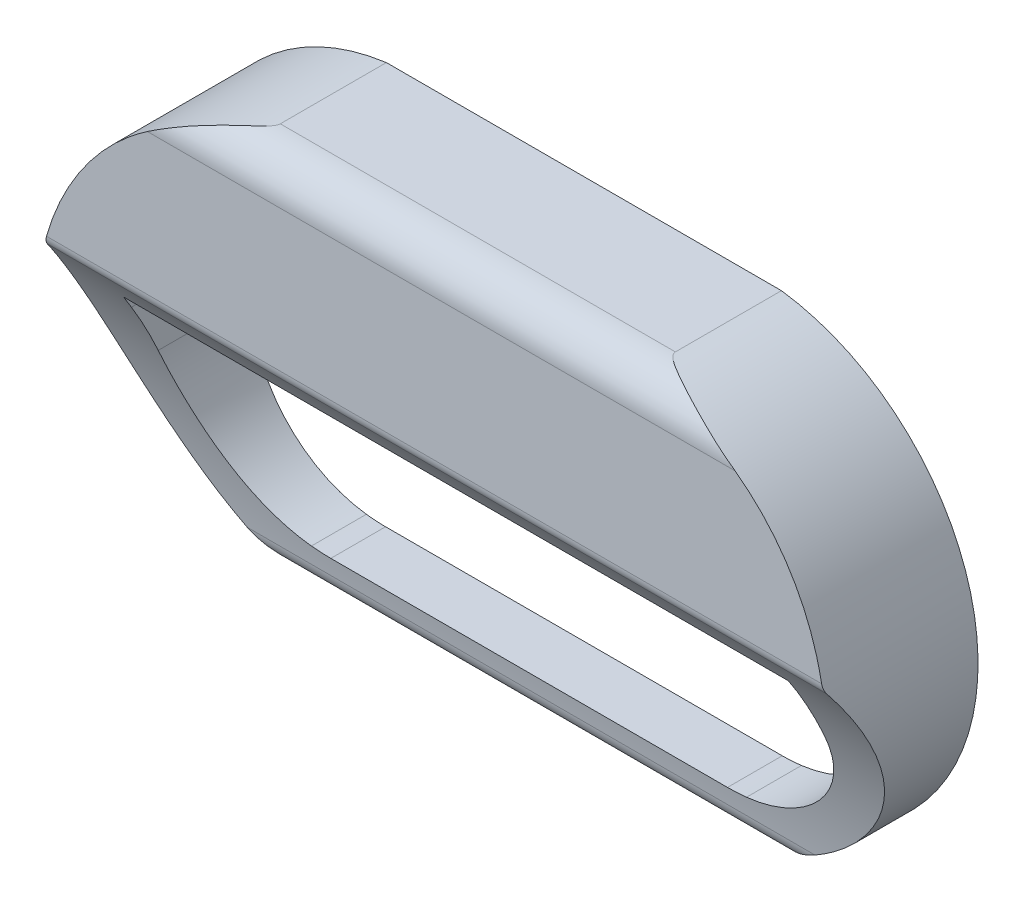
ISO-10303-21;
HEADER;
FILE_DESCRIPTION(('STEP AP214'),'2;1');
FILE_NAME('part.step','',(''),(''),'','','');
FILE_SCHEMA(('AUTOMOTIVE_DESIGN { 1 0 10303 214 1 1 1 1 }'));
ENDSEC;
DATA;
#1=APPLICATION_CONTEXT('core data for automotive mechanical design processes');
#2=APPLICATION_PROTOCOL_DEFINITION('international standard','automotive_design',2000,#1);
#3=PRODUCT_CONTEXT('',#1,'mechanical');
#4=PRODUCT('Part','Part','',(#3));
#5=PRODUCT_RELATED_PRODUCT_CATEGORY('part','',(#4));
#6=PRODUCT_DEFINITION_FORMATION('','',#4);
#7=PRODUCT_DEFINITION_CONTEXT('part definition',#1,'design');
#8=PRODUCT_DEFINITION('design','',#6,#7);
#9=PRODUCT_DEFINITION_SHAPE('','',#8);
#10=(LENGTH_UNIT() NAMED_UNIT(*) SI_UNIT(.MILLI.,.METRE.));
#11=(NAMED_UNIT(*) PLANE_ANGLE_UNIT() SI_UNIT($,.RADIAN.));
#12=(NAMED_UNIT(*) SI_UNIT($,.STERADIAN.) SOLID_ANGLE_UNIT());
#13=UNCERTAINTY_MEASURE_WITH_UNIT(LENGTH_MEASURE(1.E-05),#10,'distance_accuracy_value','');
#14=(GEOMETRIC_REPRESENTATION_CONTEXT(3) GLOBAL_UNCERTAINTY_ASSIGNED_CONTEXT((#13)) GLOBAL_UNIT_ASSIGNED_CONTEXT((#10,
#11,#12)) REPRESENTATION_CONTEXT('',''));
#15=CARTESIAN_POINT('',(0.,0.,0.));
#16=DIRECTION('',(0.,0.,1.));
#17=DIRECTION('',(1.,0.,0.));
#18=AXIS2_PLACEMENT_3D('',#15,#16,#17);
#19=CARTESIAN_POINT('',(8.,-19.0243138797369,17.5));
#20=DIRECTION('',(0.,0.,-1.));
#21=DIRECTION('',(-1.,0.,0.));
#22=AXIS2_PLACEMENT_3D('',#19,#20,#21);
#23=CYLINDRICAL_SURFACE('',#22,18.);
#24=CARTESIAN_POINT('',(8.,-19.0243138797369,0.25));
#25=DIRECTION('',(0.,0.,-1.));
#26=DIRECTION('',(-1.,0.,0.));
#27=AXIS2_PLACEMENT_3D('',#24,#25,#26);
#28=CIRCLE('',#27,18.);
#29=CARTESIAN_POINT('',(-0.18740237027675,-2.9941410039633,0.25));
#30=VERTEX_POINT('',#29);
#31=CARTESIAN_POINT('',(2.2708610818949,-1.9604055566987,0.25));
#32=VERTEX_POINT('',#31);
#33=EDGE_CURVE('E22',#30,#32,#28,.T.);
#34=ORIENTED_EDGE('',*,*,#33,.T.);
#35=DIRECTION('',(0.,0.,-1.));
#36=VECTOR('',#35,1.);
#37=CARTESIAN_POINT('',(2.2708610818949,-1.9604055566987,0.125));
#38=LINE('',#37,#36);
#39=CARTESIAN_POINT('',(2.2708610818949,-1.9604055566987,0.));
#40=VERTEX_POINT('',#39);
#41=EDGE_CURVE('E9',#32,#40,#38,.T.);
#42=ORIENTED_EDGE('',*,*,#41,.T.);
#43=CARTESIAN_POINT('',(8.,-19.0243138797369,0.));
#44=DIRECTION('',(0.,0.,1.));
#45=DIRECTION('',(1.,0.,0.));
#46=AXIS2_PLACEMENT_3D('',#43,#44,#45);
#47=CIRCLE('',#46,18.);
#48=CARTESIAN_POINT('',(5.7643312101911,-1.1636928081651,0.));
#49=VERTEX_POINT('',#48);
#50=EDGE_CURVE('E192',#49,#40,#47,.T.);
#51=ORIENTED_EDGE('',*,*,#50,.F.);
#52=DIRECTION('',(0.,0.,-1.));
#53=VECTOR('',#52,1.);
#54=CARTESIAN_POINT('',(5.7643312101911,-1.1636928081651,17.5));
#55=LINE('',#54,#53);
#56=CARTESIAN_POINT('',(5.7643312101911,-1.1636928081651,17.5));
#57=VERTEX_POINT('',#56);
#58=EDGE_CURVE('E238',#57,#49,#55,.T.);
#59=ORIENTED_EDGE('',*,*,#58,.F.);
#60=CARTESIAN_POINT('',(8.,-19.0243138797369,17.5));
#61=DIRECTION('',(0.,0.,1.));
#62=DIRECTION('',(1.,0.,0.));
#63=AXIS2_PLACEMENT_3D('',#60,#61,#62);
#64=CIRCLE('',#63,18.);
#65=CARTESIAN_POINT('',(-9.90822041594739,-17.2089236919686,17.5));
#66=VERTEX_POINT('',#65);
#67=EDGE_CURVE('E237',#57,#66,#64,.T.);
#68=ORIENTED_EDGE('',*,*,#67,.T.);
#69=CARTESIAN_POINT('',(-10.,-19.0243138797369,16.3543347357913));
#70=CARTESIAN_POINT('',(-10.0000000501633,-18.8712426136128,16.4474368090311));
#71=CARTESIAN_POINT('',(-9.9980474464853,-18.7185578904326,16.5411718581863));
#72=CARTESIAN_POINT('',(-9.99029831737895,-18.4141172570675,16.7298081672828));
#73=CARTESIAN_POINT('',(-9.98450377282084,-18.2623609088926,16.8247088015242));
#74=CARTESIAN_POINT('',(-9.96913205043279,-17.9597753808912,17.0156722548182));
#75=CARTESIAN_POINT('',(-9.95955488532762,-17.8089461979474,17.1117350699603));
#76=CARTESIAN_POINT('',(-9.93667122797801,-17.5082074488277,17.3050214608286));
#77=CARTESIAN_POINT('',(-9.92336281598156,-17.358298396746,17.4022456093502));
#78=CARTESIAN_POINT('',(-9.90822041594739,-17.2089236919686,17.5));
#79=B_SPLINE_CURVE_WITH_KNOTS('',3,(#69,#70,#71,#72,#73,#74,#75,#76,#77,#78),.UNSPECIFIED.,.F.,
.F.,(4,2,2,2,4),(0.,0.537470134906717,1.07466337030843,1.61185479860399,2.14932312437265),.UNSPECIFIED.);
#80=CARTESIAN_POINT('',(-10.,-19.0243138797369,16.3543347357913));
#81=VERTEX_POINT('',#80);
#82=EDGE_CURVE('E471',#81,#66,#79,.T.);
#83=ORIENTED_EDGE('',*,*,#82,.F.);
#84=DIRECTION('',(0.,0.,-1.));
#85=VECTOR('',#84,1.);
#86=CARTESIAN_POINT('',(-10.,-19.0243138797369,17.5));
#87=LINE('',#86,#85);
#88=CARTESIAN_POINT('',(-10.,-19.0243138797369,0.));
#89=VERTEX_POINT('',#88);
#90=EDGE_CURVE('E261',#81,#89,#87,.T.);
#91=ORIENTED_EDGE('',*,*,#90,.T.);
#92=CARTESIAN_POINT('',(-0.18740237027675,-2.9941410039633,0.));
#93=VERTEX_POINT('',#92);
#94=EDGE_CURVE('E201',#93,#89,#47,.T.);
#95=ORIENTED_EDGE('',*,*,#94,.F.);
#96=DIRECTION('',(0.,0.,-1.));
#97=VECTOR('',#96,1.);
#98=CARTESIAN_POINT('',(-0.18740237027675,-2.9941410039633,0.125));
#99=LINE('',#98,#97);
#100=EDGE_CURVE('E183',#93,#30,#99,.F.);
#101=ORIENTED_EDGE('',*,*,#100,.T.);
#102=EDGE_LOOP('',(#34,#42,#51,#59,#68,#83,#91,#95,#101));
#103=FACE_BOUND('',#102,.T.);
#104=ADVANCED_FACE('F14',(#103),#23,.F.);
#105=CARTESIAN_POINT('',(63.,-19.0243138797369,17.5));
#106=DIRECTION('',(0.,0.,-1.));
#107=DIRECTION('',(-1.,0.,0.));
#108=AXIS2_PLACEMENT_3D('',#105,#106,#107);
#109=CYLINDRICAL_SURFACE('',#108,18.);
#110=CARTESIAN_POINT('',(63.,-19.0243138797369,0.25));
#111=DIRECTION('',(0.,0.,-1.));
#112=DIRECTION('',(-1.,0.,0.));
#113=AXIS2_PLACEMENT_3D('',#110,#111,#112);
#114=CIRCLE('',#113,18.);
#115=CARTESIAN_POINT('',(68.7291389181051,-1.9604055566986,0.25));
#116=VERTEX_POINT('',#115);
#117=CARTESIAN_POINT('',(71.1874023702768,-2.9941410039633,0.25));
#118=VERTEX_POINT('',#117);
#119=EDGE_CURVE('E482',#116,#118,#114,.T.);
#120=ORIENTED_EDGE('',*,*,#119,.T.);
#121=DIRECTION('',(0.,0.,-1.));
#122=VECTOR('',#121,1.);
#123=CARTESIAN_POINT('',(71.1874023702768,-2.9941410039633,0.125));
#124=LINE('',#123,#122);
#125=CARTESIAN_POINT('',(71.1874023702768,-2.9941410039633,0.));
#126=VERTEX_POINT('',#125);
#127=EDGE_CURVE('E485',#118,#126,#124,.T.);
#128=ORIENTED_EDGE('',*,*,#127,.T.);
#129=CARTESIAN_POINT('',(63.,-19.0243138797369,0.));
#130=DIRECTION('',(0.,0.,1.));
#131=DIRECTION('',(1.,0.,0.));
#132=AXIS2_PLACEMENT_3D('',#129,#130,#131);
#133=CIRCLE('',#132,18.);
#134=CARTESIAN_POINT('',(81.,-19.0243138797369,0.));
#135=VERTEX_POINT('',#134);
#136=EDGE_CURVE('E228',#135,#126,#133,.T.);
#137=ORIENTED_EDGE('',*,*,#136,.F.);
#138=DIRECTION('',(0.,0.,-1.));
#139=VECTOR('',#138,1.);
#140=CARTESIAN_POINT('',(81.,-19.0243138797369,17.5));
#141=LINE('',#140,#139);
#142=CARTESIAN_POINT('',(81.,-19.0243138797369,16.3543347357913));
#143=VERTEX_POINT('',#142);
#144=EDGE_CURVE('E247',#143,#135,#141,.T.);
#145=ORIENTED_EDGE('',*,*,#144,.F.);
#146=CARTESIAN_POINT('',(80.9082204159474,-17.2089236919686,17.5));
#147=CARTESIAN_POINT('',(80.9233628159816,-17.358298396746,17.4022456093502));
#148=CARTESIAN_POINT('',(80.936671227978,-17.5082074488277,17.3050214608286));
#149=CARTESIAN_POINT('',(80.9595548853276,-17.8089461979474,17.1117350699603));
#150=CARTESIAN_POINT('',(80.9691320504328,-17.9597753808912,17.0156722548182));
#151=CARTESIAN_POINT('',(80.9845037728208,-18.2623609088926,16.8247088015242));
#152=CARTESIAN_POINT('',(80.990298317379,-18.4141172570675,16.7298081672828));
#153=CARTESIAN_POINT('',(80.9980474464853,-18.7185578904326,16.5411718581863));
#154=CARTESIAN_POINT('',(81.0000000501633,-18.8712426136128,16.4474368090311));
#155=CARTESIAN_POINT('',(81.,-19.0243138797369,16.3543347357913));
#156=B_SPLINE_CURVE_WITH_KNOTS('',3,(#146,#147,#148,#149,#150,#151,#152,#153,#154,#155),
.UNSPECIFIED.,.F.,.F.,(4,2,2,2,4),(0.,0.537468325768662,1.07465975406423,1.61185298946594,
2.14932312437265),.UNSPECIFIED.);
#157=CARTESIAN_POINT('',(80.9082204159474,-17.2089236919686,17.5));
#158=VERTEX_POINT('',#157);
#159=EDGE_CURVE('E387',#158,#143,#156,.T.);
#160=ORIENTED_EDGE('',*,*,#159,.F.);
#161=CARTESIAN_POINT('',(63.,-19.0243138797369,17.5));
#162=DIRECTION('',(0.,0.,1.));
#163=DIRECTION('',(1.,0.,0.));
#164=AXIS2_PLACEMENT_3D('',#161,#162,#163);
#165=CIRCLE('',#164,18.);
#166=CARTESIAN_POINT('',(65.2356687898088,-1.1636928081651,17.5));
#167=VERTEX_POINT('',#166);
#168=EDGE_CURVE('E521',#158,#167,#165,.T.);
#169=ORIENTED_EDGE('',*,*,#168,.T.);
#170=DIRECTION('',(0.,0.,-1.));
#171=VECTOR('',#170,1.);
#172=CARTESIAN_POINT('',(65.2356687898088,-1.1636928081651,17.5));
#173=LINE('',#172,#171);
#174=CARTESIAN_POINT('',(65.2356687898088,-1.1636928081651,0.));
#175=VERTEX_POINT('',#174);
#176=EDGE_CURVE('E244',#167,#175,#173,.T.);
#177=ORIENTED_EDGE('',*,*,#176,.T.);
#178=CARTESIAN_POINT('',(68.7291389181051,-1.9604055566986,0.));
#179=VERTEX_POINT('',#178);
#180=EDGE_CURVE('E227',#179,#175,#133,.T.);
#181=ORIENTED_EDGE('',*,*,#180,.F.);
#182=DIRECTION('',(0.,0.,-1.));
#183=VECTOR('',#182,1.);
#184=CARTESIAN_POINT('',(68.7291389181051,-1.9604055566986,0.125));
#185=LINE('',#184,#183);
#186=EDGE_CURVE('E478',#179,#116,#185,.F.);
#187=ORIENTED_EDGE('',*,*,#186,.T.);
#188=EDGE_LOOP('',(#120,#128,#137,#145,#160,#169,#177,#181,#187));
#189=FACE_BOUND('',#188,.T.);
#190=ADVANCED_FACE('F403',(#189),#109,.F.);
#191=CARTESIAN_POINT('',(89.5,-52.8020162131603,71.8887099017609));
#192=DIRECTION('',(-1.,0.,0.));
#193=DIRECTION('',(0.,0.,1.));
#194=AXIS2_PLACEMENT_3D('',#191,#192,#193);
#195=CYLINDRICAL_SURFACE('',#194,65.);
#196=CARTESIAN_POINT('',(88.7510220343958,-13.5465357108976,20.0813045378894));
#197=CARTESIAN_POINT('',(88.829231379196,-13.9317663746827,19.7894003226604));
#198=CARTESIAN_POINT('',(88.9006510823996,-14.3211507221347,19.5011274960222));
#199=CARTESIAN_POINT('',(89.0292067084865,-15.1078679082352,18.9322498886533));
#200=CARTESIAN_POINT('',(89.0863408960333,-15.5052017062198,18.6516460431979));
#201=CARTESIAN_POINT('',(89.185651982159,-16.3077718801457,18.098302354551));
#202=CARTESIAN_POINT('',(89.2278136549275,-16.7130158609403,17.8255707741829));
#203=CARTESIAN_POINT('',(89.2963765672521,-17.5304475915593,17.2887495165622));
#204=CARTESIAN_POINT('',(89.3227783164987,-17.9426351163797,17.0246595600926));
#205=CARTESIAN_POINT('',(89.3774956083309,-19.1942969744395,16.2425736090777));
#206=CARTESIAN_POINT('',(89.3806666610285,-20.0437138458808,15.7383199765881));
#207=CARTESIAN_POINT('',(89.3145335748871,-21.7622531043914,14.7703625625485));
#208=CARTESIAN_POINT('',(89.2452524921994,-22.6313691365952,14.3066459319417));
#209=CARTESIAN_POINT('',(89.0284440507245,-24.3881082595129,13.4197077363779));
#210=CARTESIAN_POINT('',(88.8803900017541,-25.2758168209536,12.9967816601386));
#211=CARTESIAN_POINT('',(88.5015521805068,-27.0548113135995,12.1975685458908));
#212=CARTESIAN_POINT('',(88.2707596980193,-27.9460976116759,11.8212864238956));
#213=CARTESIAN_POINT('',(87.7248278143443,-29.7183007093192,11.1182606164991));
#214=CARTESIAN_POINT('',(87.4100043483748,-30.599243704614,10.7913384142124));
#215=CARTESIAN_POINT('',(86.6948352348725,-32.3426965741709,10.1856502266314));
#216=CARTESIAN_POINT('',(86.294505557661,-33.2052098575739,9.90687526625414));
#217=CARTESIAN_POINT('',(85.4690601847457,-34.7862177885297,9.43057539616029));
#218=CARTESIAN_POINT('',(85.054514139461,-35.5084839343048,9.22716575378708));
#219=CARTESIAN_POINT('',(84.164122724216,-36.9232770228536,8.85379266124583));
#220=CARTESIAN_POINT('',(83.6882797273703,-37.6158051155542,8.6838279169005));
#221=CARTESIAN_POINT('',(82.6776293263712,-38.964847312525,8.37483473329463));
#222=CARTESIAN_POINT('',(82.1427613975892,-39.6213233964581,8.23583849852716));
#223=CARTESIAN_POINT('',(81.018140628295,-40.8910647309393,7.98606638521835));
#224=CARTESIAN_POINT('',(80.4283988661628,-41.5043386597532,7.87528482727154));
#225=CARTESIAN_POINT('',(79.3956228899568,-42.4931774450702,7.71011136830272));
#226=CARTESIAN_POINT('',(78.966160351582,-42.881923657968,7.64902691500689));
#227=CARTESIAN_POINT('',(78.0854024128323,-43.635287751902,7.53720631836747));
#228=CARTESIAN_POINT('',(77.634111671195,-43.9999107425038,7.48646797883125));
#229=CARTESIAN_POINT('',(76.7124733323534,-44.7026594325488,7.39432435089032));
#230=CARTESIAN_POINT('',(76.2421827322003,-45.0408565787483,7.35289328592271));
#231=CARTESIAN_POINT('',(75.2828733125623,-45.6907081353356,7.27806042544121));
#232=CARTESIAN_POINT('',(74.7938513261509,-46.0023580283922,7.24465999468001));
#233=CARTESIAN_POINT('',(74.2962983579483,-46.3000889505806,7.21472021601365));
#234=B_SPLINE_CURVE_WITH_KNOTS('',3,(#196,#197,#198,#199,#200,#201,#202,#203,#204,#205,#206,
#207,#208,#209,#210,#211,#212,#213,#214,#215,#216,#217,#218,#219,#220,#221,#222,#223,#224,#225,
#226,#227,#228,#229,#230,#231,#232,#233),.UNSPECIFIED.,.F.,.F.,(4,2,2,2,2,2,2,2,2,2,2,2,2,2,2,2,
2,2,4),(0.,1.4688062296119,2.93779079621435,4.40826494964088,5.87869154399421,8.83838957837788,
11.7971460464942,14.7759385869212,17.7550448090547,20.7231043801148,23.6906100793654,
26.2591236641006,28.8275378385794,31.3986105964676,33.9691654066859,35.7157126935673,
37.4618888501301,39.2031676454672,40.9447421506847),.UNSPECIFIED.);
#235=CARTESIAN_POINT('',(88.7510220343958,-13.5465357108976,20.0813045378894));
#236=VERTEX_POINT('',#235);
#237=CARTESIAN_POINT('',(74.2962983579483,-46.3000889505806,7.21472021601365));
#238=VERTEX_POINT('',#237);
#239=EDGE_CURVE('E351',#236,#238,#234,.T.);
#240=ORIENTED_EDGE('',*,*,#239,.F.);
#241=DIRECTION('',(-1.,0.,0.));
#242=VECTOR('',#241,1.);
#243=CARTESIAN_POINT('',(89.5,-13.5465357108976,20.0813045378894));
#244=LINE('',#243,#242);
#245=CARTESIAN_POINT('',(-17.7510220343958,-13.5465357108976,20.0813045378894));
#246=VERTEX_POINT('',#245);
#247=EDGE_CURVE('E373',#236,#246,#244,.T.);
#248=ORIENTED_EDGE('',*,*,#247,.T.);
#249=CARTESIAN_POINT('',(-3.2962983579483,-46.3000889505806,7.21472021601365));
#250=CARTESIAN_POINT('',(-3.65325326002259,-46.0864704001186,7.23619879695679));
#251=CARTESIAN_POINT('',(-4.00578611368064,-45.8657324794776,7.25945684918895));
#252=CARTESIAN_POINT('',(-4.70149307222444,-45.4103852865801,7.3099490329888));
#253=CARTESIAN_POINT('',(-5.04466700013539,-45.1757757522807,7.33718323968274));
#254=CARTESIAN_POINT('',(-6.05929725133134,-44.4517469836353,7.42546919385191));
#255=CARTESIAN_POINT('',(-6.71592675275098,-43.9420888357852,7.49310800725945));
#256=CARTESIAN_POINT('',(-7.98495481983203,-42.8728368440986,7.64928753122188));
#257=CARTESIAN_POINT('',(-8.59733199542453,-42.3132191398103,7.73783826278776));
#258=CARTESIAN_POINT('',(-9.77330651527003,-41.148911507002,7.93908901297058));
#259=CARTESIAN_POINT('',(-10.3369074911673,-40.5442249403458,8.05178723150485));
#260=CARTESIAN_POINT('',(-11.4124704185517,-39.2939968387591,8.30458641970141));
#261=CARTESIAN_POINT('',(-11.9243397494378,-38.6483852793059,8.4447352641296));
#262=CARTESIAN_POINT('',(-12.8920696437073,-37.3232269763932,8.75496266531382));
#263=CARTESIAN_POINT('',(-13.3479288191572,-36.6436793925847,8.92504196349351));
#264=CARTESIAN_POINT('',(-14.200387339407,-35.2583334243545,9.29691648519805));
#265=CARTESIAN_POINT('',(-14.5970852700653,-34.5525812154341,9.49865776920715));
#266=CARTESIAN_POINT('',(-15.3305020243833,-33.1205700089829,9.9354942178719));
#267=CARTESIAN_POINT('',(-15.6672224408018,-32.3943115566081,10.1705884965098));
#268=CARTESIAN_POINT('',(-16.2742448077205,-30.9420404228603,10.6700857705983));
#269=CARTESIAN_POINT('',(-16.5456796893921,-30.2162814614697,10.9338523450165));
#270=CARTESIAN_POINT('',(-17.0304742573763,-28.7580955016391,11.4941742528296));
#271=CARTESIAN_POINT('',(-17.2438339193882,-28.025668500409,11.7907295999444));
#272=CARTESIAN_POINT('',(-17.6140957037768,-26.5583618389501,12.4167968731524));
#273=CARTESIAN_POINT('',(-17.770853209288,-25.8234806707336,12.7463905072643));
#274=CARTESIAN_POINT('',(-18.0290750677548,-24.3587385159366,13.436715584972));
#275=CARTESIAN_POINT('',(-18.1305396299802,-23.6288775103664,13.7974469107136));
#276=CARTESIAN_POINT('',(-18.2906758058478,-22.082799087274,14.5983566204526));
#277=CARTESIAN_POINT('',(-18.3418812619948,-21.2679757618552,15.0427252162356));
#278=CARTESIAN_POINT('',(-18.3809496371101,-19.6568342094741,15.9667994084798));
#279=CARTESIAN_POINT('',(-18.3687883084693,-18.8605231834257,16.4465184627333));
#280=CARTESIAN_POINT('',(-18.2860358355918,-17.2950156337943,17.4359207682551));
#281=CARTESIAN_POINT('',(-18.2157142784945,-16.5257110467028,17.9454557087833));
#282=CARTESIAN_POINT('',(-18.0703817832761,-15.3924428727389,18.7310655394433));
#283=CARTESIAN_POINT('',(-18.0153249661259,-15.01827590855,18.996379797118));
#284=CARTESIAN_POINT('',(-17.8925336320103,-14.277032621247,19.533813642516));
#285=CARTESIAN_POINT('',(-17.824800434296,-13.9099555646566,19.8059325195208));
#286=CARTESIAN_POINT('',(-17.7510220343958,-13.5465357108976,20.0813045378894));
#287=B_SPLINE_CURVE_WITH_KNOTS('',3,(#249,#250,#251,#252,#253,#254,#255,#256,#257,#258,#259,
#260,#261,#262,#263,#264,#265,#266,#267,#268,#269,#270,#271,#272,#273,#274,#275,#276,#277,#278,
#279,#280,#281,#282,#283,#284,#285,#286),.UNSPECIFIED.,.F.,.F.,(4,2,2,2,2,2,2,2,2,2,2,2,2,2,2,2,
2,2,4),(0.,1.24945670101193,2.49893701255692,4.99767178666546,7.49760639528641,9.99735471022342,
12.501502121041,15.0057115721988,17.5057002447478,20.0056225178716,22.458393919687,
24.9111663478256,27.3701619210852,29.8291481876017,32.6144706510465,35.4008590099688,
38.1744036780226,39.5601025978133,40.9456573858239),.UNSPECIFIED.);
#288=CARTESIAN_POINT('',(-3.2962983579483,-46.3000889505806,7.21472021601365));
#289=VERTEX_POINT('',#288);
#290=EDGE_CURVE('E289',#289,#246,#287,.T.);
#291=ORIENTED_EDGE('',*,*,#290,.F.);
#292=DIRECTION('',(-1.,0.,0.));
#293=VECTOR('',#292,1.);
#294=CARTESIAN_POINT('',(89.5,-46.3000889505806,7.21472021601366));
#295=LINE('',#294,#293);
#296=EDGE_CURVE('E370',#238,#289,#295,.T.);
#297=ORIENTED_EDGE('',*,*,#296,.F.);
#298=EDGE_LOOP('',(#240,#248,#291,#297));
#299=FACE_BOUND('',#298,.T.);
#300=CARTESIAN_POINT('',(-10.,-52.8020162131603,71.8887099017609));
#301=DIRECTION('',(1.,0.,0.));
#302=DIRECTION('',(0.,0.,-1.));
#303=AXIS2_PLACEMENT_3D('',#300,#301,#302);
#304=CIRCLE('',#303,65.);
#305=CARTESIAN_POINT('',(-10.,-25.9756861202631,12.6827303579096));
#306=VERTEX_POINT('',#305);
#307=EDGE_CURVE('E479',#306,#81,#304,.T.);
#308=ORIENTED_EDGE('',*,*,#307,.T.);
#309=ORIENTED_EDGE('',*,*,#82,.T.);
#310=DIRECTION('',(-1.,0.,0.));
#311=VECTOR('',#310,1.);
#312=CARTESIAN_POINT('',(89.5,-17.2089236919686,17.5));
#313=LINE('',#312,#311);
#314=EDGE_CURVE('E385',#158,#66,#313,.T.);
#315=ORIENTED_EDGE('',*,*,#314,.F.);
#316=ORIENTED_EDGE('',*,*,#159,.T.);
#317=CARTESIAN_POINT('',(81.,-52.8020162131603,71.8887099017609));
#318=DIRECTION('',(-1.,0.,0.));
#319=DIRECTION('',(0.,0.,1.));
#320=AXIS2_PLACEMENT_3D('',#317,#318,#319);
#321=CIRCLE('',#320,65.);
#322=CARTESIAN_POINT('',(81.,-25.9756861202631,12.6827303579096));
#323=VERTEX_POINT('',#322);
#324=EDGE_CURVE('E401',#143,#323,#321,.T.);
#325=ORIENTED_EDGE('',*,*,#324,.T.);
#326=CARTESIAN_POINT('',(81.,-25.9756861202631,12.6827303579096));
#327=CARTESIAN_POINT('',(80.999999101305,-26.2196513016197,12.5721874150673));
#328=CARTESIAN_POINT('',(80.9950392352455,-26.4642790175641,12.4631661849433));
#329=CARTESIAN_POINT('',(80.9750404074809,-26.9545299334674,12.2482952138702));
#330=CARTESIAN_POINT('',(80.9600008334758,-27.2001531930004,12.1424456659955));
#331=CARTESIAN_POINT('',(80.8995130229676,-27.938082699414,11.829821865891));
#332=CARTESIAN_POINT('',(80.8386955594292,-28.4313437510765,11.6280199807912));
#333=CARTESIAN_POINT('',(80.6749606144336,-29.4175047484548,11.2385135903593));
#334=CARTESIAN_POINT('',(80.5719645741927,-29.910402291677,11.0508361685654));
#335=CARTESIAN_POINT('',(80.3232720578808,-30.8909677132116,10.6908452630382));
#336=CARTESIAN_POINT('',(80.1775821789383,-31.3786363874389,10.5185294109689));
#337=CARTESIAN_POINT('',(79.8428232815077,-32.3460962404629,10.1892993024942));
#338=CARTESIAN_POINT('',(79.6536201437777,-32.8258580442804,10.0324348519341));
#339=CARTESIAN_POINT('',(79.2324622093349,-33.7715234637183,9.73498058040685));
#340=CARTESIAN_POINT('',(79.0005049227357,-34.237426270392,9.59439170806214));
#341=CARTESIAN_POINT('',(78.4951806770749,-35.1501665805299,9.32963605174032));
#342=CARTESIAN_POINT('',(78.2218740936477,-35.5970306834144,9.20544581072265));
#343=CARTESIAN_POINT('',(77.6351639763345,-36.4679508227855,8.97288138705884));
#344=CARTESIAN_POINT('',(77.3217630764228,-36.8920083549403,8.86450616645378));
#345=CARTESIAN_POINT('',(76.6757284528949,-37.6899041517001,8.66859243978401));
#346=CARTESIAN_POINT('',(76.345176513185,-38.0652258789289,8.58022345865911));
#347=CARTESIAN_POINT('',(75.65244283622,-38.7884311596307,8.41622018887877));
#348=CARTESIAN_POINT('',(75.2902618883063,-39.1363153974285,8.34058558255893));
#349=CARTESIAN_POINT('',(74.5364500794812,-39.8018646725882,8.20109899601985));
#350=CARTESIAN_POINT('',(74.1447979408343,-40.1195074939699,8.1372556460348));
#351=CARTESIAN_POINT('',(73.5377187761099,-40.5708958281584,8.0496685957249));
#352=CARTESIAN_POINT('',(73.3320847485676,-40.7171839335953,8.02183508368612));
#353=CARTESIAN_POINT('',(72.9145639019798,-41.0011703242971,7.96875293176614));
#354=CARTESIAN_POINT('',(72.7026754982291,-41.1388664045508,7.94350495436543));
#355=CARTESIAN_POINT('',(72.067219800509,-41.5330136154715,7.87246255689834));
#356=CARTESIAN_POINT('',(71.6353432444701,-41.7768479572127,7.83015855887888));
#357=CARTESIAN_POINT('',(70.752340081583,-42.2282890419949,7.75409560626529));
#358=CARTESIAN_POINT('',(70.3012136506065,-42.4358961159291,7.72033657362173));
#359=CARTESIAN_POINT('',(69.6128980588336,-42.7187761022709,7.67549224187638));
#360=CARTESIAN_POINT('',(69.3816540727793,-42.8082723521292,7.66151601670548));
#361=CARTESIAN_POINT('',(68.9156366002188,-42.9776479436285,7.63538996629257));
#362=CARTESIAN_POINT('',(68.6808639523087,-43.0575295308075,7.62323971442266));
#363=CARTESIAN_POINT('',(67.9719464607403,-43.2824867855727,7.58939651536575));
#364=CARTESIAN_POINT('',(67.4929310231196,-43.4129863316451,7.57029374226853));
#365=CARTESIAN_POINT('',(66.7164133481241,-43.5904151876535,7.54470525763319));
#366=CARTESIAN_POINT('',(66.4217839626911,-43.6500101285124,7.53621421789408));
#367=CARTESIAN_POINT('',(65.8303228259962,-43.7543050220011,7.52147014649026));
#368=CARTESIAN_POINT('',(65.5334952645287,-43.7990282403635,7.51521361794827));
#369=CARTESIAN_POINT('',(65.235668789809,-43.8363071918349,7.51001729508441));
#370=B_SPLINE_CURVE_WITH_KNOTS('',3,(#326,#327,#328,#329,#330,#331,#332,#333,#334,#335,#336,
#337,#338,#339,#340,#341,#342,#343,#344,#345,#346,#347,#348,#349,#350,#351,#352,#353,#354,#355,
#356,#357,#358,#359,#360,#361,#362,#363,#364,#365,#366,#367,#368,#369),.UNSPECIFIED.,.F.,.F.,(4,
2,2,2,2,2,2,2,2,2,2,2,2,2,2,2,2,2,2,2,2,4),(0.,0.803419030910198,1.60688687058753,
3.21416710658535,4.82445466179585,6.4344935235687,8.0495630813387,9.66472672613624,
11.2775543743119,12.8902761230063,14.4120363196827,15.933758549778,17.4565901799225,
18.21805887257,18.9797221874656,20.471119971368,21.9625041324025,22.7073658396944,
23.4520532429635,24.9405500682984,25.8423618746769,26.742756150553),.UNSPECIFIED.);
#371=CARTESIAN_POINT('',(65.2356687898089,-43.8363071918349,7.51001729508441));
#372=VERTEX_POINT('',#371);
#373=EDGE_CURVE('E423',#323,#372,#370,.T.);
#374=ORIENTED_EDGE('',*,*,#373,.T.);
#375=CARTESIAN_POINT('',(65.2356687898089,-43.8363071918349,7.51001729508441));
#376=CARTESIAN_POINT('',(65.0179051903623,-43.8635671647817,7.50622311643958));
#377=CARTESIAN_POINT('',(64.7997153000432,-43.8874331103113,7.50291543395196));
#378=CARTESIAN_POINT('',(64.3629014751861,-43.9283407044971,7.49726315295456));
#379=CARTESIAN_POINT('',(64.1442781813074,-43.9453890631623,7.49491760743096));
#380=CARTESIAN_POINT('',(63.4875772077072,-43.9863342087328,7.48929819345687));
#381=CARTESIAN_POINT('',(63.0488298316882,-44.0000108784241,7.48744433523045));
#382=CARTESIAN_POINT('',(62.61,-44.,7.48743265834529));
#383=B_SPLINE_CURVE_WITH_KNOTS('',3,(#375,#376,#377,#378,#379,#380,#381,#382),.UNSPECIFIED.,.F.,
.F.,(4,2,2,4),(0.,0.658446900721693,1.31624414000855,2.63232571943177),.UNSPECIFIED.);
#384=CARTESIAN_POINT('',(62.61,-44.,7.48743265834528));
#385=VERTEX_POINT('',#384);
#386=EDGE_CURVE('E430',#372,#385,#383,.T.);
#387=ORIENTED_EDGE('',*,*,#386,.T.);
#388=DIRECTION('',(-1.,0.,0.));
#389=VECTOR('',#388,1.);
#390=CARTESIAN_POINT('',(89.5,-44.,7.48743265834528));
#391=LINE('',#390,#389);
#392=CARTESIAN_POINT('',(8.39,-44.,7.48743265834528));
#393=VERTEX_POINT('',#392);
#394=EDGE_CURVE('E437',#385,#393,#391,.T.);
#395=ORIENTED_EDGE('',*,*,#394,.T.);
#396=CARTESIAN_POINT('',(8.39,-44.,7.48743265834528));
#397=CARTESIAN_POINT('',(7.95117016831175,-44.0000108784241,7.48744433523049));
#398=CARTESIAN_POINT('',(7.51242279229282,-43.9863342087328,7.4892981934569));
#399=CARTESIAN_POINT('',(6.85572181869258,-43.9453890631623,7.49491760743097));
#400=CARTESIAN_POINT('',(6.63709852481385,-43.9283407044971,7.49726315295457));
#401=CARTESIAN_POINT('',(6.20028469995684,-43.8874331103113,7.50291543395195));
#402=CARTESIAN_POINT('',(5.98209480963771,-43.8635671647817,7.50622311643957));
#403=CARTESIAN_POINT('',(5.7643312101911,-43.8363071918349,7.5100172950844));
#404=B_SPLINE_CURVE_WITH_KNOTS('',3,(#396,#397,#398,#399,#400,#401,#402,#403),.UNSPECIFIED.,.F.,
.F.,(4,2,2,4),(0.,1.31608157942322,1.97387881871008,2.63232571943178),.UNSPECIFIED.);
#405=CARTESIAN_POINT('',(5.76433121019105,-43.8363071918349,7.51001729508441));
#406=VERTEX_POINT('',#405);
#407=EDGE_CURVE('E440',#393,#406,#404,.T.);
#408=ORIENTED_EDGE('',*,*,#407,.T.);
#409=CARTESIAN_POINT('',(5.7643312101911,-43.8363071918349,7.51001729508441));
#410=CARTESIAN_POINT('',(5.51652543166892,-43.8052890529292,7.51433902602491));
#411=CARTESIAN_POINT('',(5.26940531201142,-43.769117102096,7.51939715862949));
#412=CARTESIAN_POINT('',(4.77692365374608,-43.6865337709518,7.53103927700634));
#413=CARTESIAN_POINT('',(4.53156207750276,-43.6401226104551,7.53762323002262));
#414=CARTESIAN_POINT('',(3.79879272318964,-43.4856540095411,7.55974031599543));
#415=CARTESIAN_POINT('',(3.31458573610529,-43.3623470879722,7.57764061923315));
#416=CARTESIAN_POINT('',(2.35861123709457,-43.0760827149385,7.62031085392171));
#417=CARTESIAN_POINT('',(1.88683761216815,-42.9131451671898,7.6450773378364));
#418=CARTESIAN_POINT('',(1.19096842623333,-42.6399963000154,7.68791718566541));
#419=CARTESIAN_POINT('',(0.960969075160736,-42.544152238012,7.70314614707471));
#420=CARTESIAN_POINT('',(0.505203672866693,-42.3430343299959,7.73561113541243));
#421=CARTESIAN_POINT('',(0.279438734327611,-42.2377580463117,7.75284768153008));
#422=CARTESIAN_POINT('',(-0.391035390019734,-41.9079995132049,7.80774426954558));
#423=CARTESIAN_POINT('',(-0.828759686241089,-41.6696520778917,7.84858134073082));
#424=CARTESIAN_POINT('',(-1.68223431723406,-41.1579748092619,7.93963832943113));
#425=CARTESIAN_POINT('',(-2.09798477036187,-40.8846451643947,7.98985819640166));
#426=CARTESIAN_POINT('',(-2.70278392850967,-40.4502180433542,8.072921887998));
#427=CARTESIAN_POINT('',(-2.90124370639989,-40.3013387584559,8.10189838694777));
#428=CARTESIAN_POINT('',(-3.29154010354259,-39.9957623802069,8.16254470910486));
#429=CARTESIAN_POINT('',(-3.48337840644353,-39.8390672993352,8.19421384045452));
#430=CARTESIAN_POINT('',(-4.04855535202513,-39.3576565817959,8.29345443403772));
#431=CARTESIAN_POINT('',(-4.41159980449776,-39.0215839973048,8.36526503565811));
#432=CARTESIAN_POINT('',(-5.10586097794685,-38.3238662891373,8.52065568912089));
#433=CARTESIAN_POINT('',(-5.43722022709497,-37.9623497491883,8.60417841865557));
#434=CARTESIAN_POINT('',(-6.06797987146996,-37.2153861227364,8.7839994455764));
#435=CARTESIAN_POINT('',(-6.36738025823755,-36.8299390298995,8.88029774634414));
#436=CARTESIAN_POINT('',(-6.93248064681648,-36.038367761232,9.08626295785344));
#437=CARTESIAN_POINT('',(-7.19817463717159,-35.6322399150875,9.19593224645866));
#438=CARTESIAN_POINT('',(-7.69442324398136,-34.8028385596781,9.42900185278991));
#439=CARTESIAN_POINT('',(-7.92497836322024,-34.3795652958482,9.55240197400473));
#440=CARTESIAN_POINT('',(-8.35130013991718,-33.5167702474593,9.81388648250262));
#441=CARTESIAN_POINT('',(-8.54684484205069,-33.0771647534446,9.95205626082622));
#442=CARTESIAN_POINT('',(-8.90087350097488,-32.1877396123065,10.2423762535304));
#443=CARTESIAN_POINT('',(-9.05935441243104,-31.7379191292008,10.3945276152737));
#444=CARTESIAN_POINT('',(-9.33907381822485,-30.831745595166,10.7124263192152));
#445=CARTESIAN_POINT('',(-9.46032361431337,-30.3753945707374,10.8781695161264));
#446=CARTESIAN_POINT('',(-9.6658826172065,-29.4594816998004,11.2226940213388));
#447=CARTESIAN_POINT('',(-9.75020259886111,-28.9999208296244,11.4014715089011));
#448=CARTESIAN_POINT('',(-9.87815820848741,-28.1109913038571,11.7591236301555));
#449=CARTESIAN_POINT('',(-9.92411543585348,-27.6816356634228,11.9372101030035));
#450=CARTESIAN_POINT('',(-9.98501030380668,-26.8260402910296,12.3029253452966));
#451=CARTESIAN_POINT('',(-10.0000241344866,-26.3997954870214,12.4905295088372));
#452=CARTESIAN_POINT('',(-10.,-25.9756861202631,12.6827303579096));
#453=B_SPLINE_CURVE_WITH_KNOTS('',3,(#409,#410,#411,#412,#413,#414,#415,#416,#417,#418,#419,
#420,#421,#422,#423,#424,#425,#426,#427,#428,#429,#430,#431,#432,#433,#434,#435,#436,#437,#438,
#439,#440,#441,#442,#443,#444,#445,#446,#447,#448,#449,#450,#451,#452),.UNSPECIFIED.,.F.,.F.,(4,
2,2,2,2,2,2,2,2,2,2,2,2,2,2,2,2,2,2,2,2,4),(0.,0.749220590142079,1.49842509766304,
2.99648874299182,4.4938015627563,5.24251252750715,5.99141755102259,7.48975594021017,
8.98808625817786,9.7372340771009,10.4861899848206,11.9839396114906,13.4745993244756,
14.9652594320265,16.4561850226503,17.9470892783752,19.4471343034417,20.9473025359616,
22.4470149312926,23.9462894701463,25.3464226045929,26.7431041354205),.UNSPECIFIED.);
#454=EDGE_CURVE('E448',#406,#306,#453,.T.);
#455=ORIENTED_EDGE('',*,*,#454,.T.);
#456=EDGE_LOOP('',(#308,#309,#315,#316,#325,#374,#387,#395,#408,#455));
#457=FACE_BOUND('',#456,.T.);
#458=ADVANCED_FACE('F338',(#299,#457),#195,.F.);
#459=CARTESIAN_POINT('',(89.5,6.,19.5));
#460=DIRECTION('',(0.,-0.0538548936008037,-0.99854877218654));
#461=DIRECTION('',(0.,0.99854877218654,-0.0538548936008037));
#462=AXIS2_PLACEMENT_3D('',#459,#460,#461);
#463=PLANE('',#462);
#464=DIRECTION('',(-1.,0.,0.));
#465=VECTOR('',#464,1.);
#466=CARTESIAN_POINT('',(89.5,-12.2964231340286,20.4867839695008));
#467=LINE('',#466,#465);
#468=CARTESIAN_POINT('',(88.470193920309,-12.2964231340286,20.4867839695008));
#469=VERTEX_POINT('',#468);
#470=CARTESIAN_POINT('',(-17.4701939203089,-12.2964231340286,20.4867839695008));
#471=VERTEX_POINT('',#470);
#472=EDGE_CURVE('E375',#469,#471,#467,.T.);
#473=ORIENTED_EDGE('',*,*,#472,.F.);
#474=CARTESIAN_POINT('',(58.3844247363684,-19.7115575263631,20.886705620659));
#475=DIRECTION('',(0.,-0.0538548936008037,-0.99854877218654));
#476=DIRECTION('',(0.,0.99854877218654,-0.0538548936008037));
#477=AXIS2_PLACEMENT_3D('',#474,#475,#476);
#478=ELLIPSE('',#477,31.0311224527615,30.9860892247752);
#479=CARTESIAN_POINT('',(75.6775891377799,6.,19.5));
#480=VERTEX_POINT('',#479);
#481=EDGE_CURVE('E329',#469,#480,#478,.F.);
#482=ORIENTED_EDGE('',*,*,#481,.T.);
#483=DIRECTION('',(-1.,0.,0.));
#484=VECTOR('',#483,1.);
#485=CARTESIAN_POINT('',(89.5,6.,19.5));
#486=LINE('',#485,#484);
#487=CARTESIAN_POINT('',(-4.6775891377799,6.,19.5));
#488=VERTEX_POINT('',#487);
#489=EDGE_CURVE('E350',#480,#488,#486,.T.);
#490=ORIENTED_EDGE('',*,*,#489,.T.);
#491=CARTESIAN_POINT('',(12.6155752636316,-19.7115575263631,20.886705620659));
#492=DIRECTION('',(0.,-0.0538548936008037,-0.99854877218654));
#493=DIRECTION('',(0.,0.99854877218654,-0.0538548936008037));
#494=AXIS2_PLACEMENT_3D('',#491,#492,#493);
#495=ELLIPSE('',#494,31.0311224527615,30.9860892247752);
#496=EDGE_CURVE('E272',#488,#471,#495,.F.);
#497=ORIENTED_EDGE('',*,*,#496,.T.);
#498=EDGE_LOOP('',(#473,#482,#490,#497));
#499=FACE_BOUND('',#498,.T.);
#500=ADVANCED_FACE('F16',(#499),#463,.F.);
#501=CARTESIAN_POINT('',(89.5,-49.,0.));
#502=DIRECTION('',(0.,0.,1.));
#503=DIRECTION('',(1.,0.,0.));
#504=AXIS2_PLACEMENT_3D('',#501,#502,#503);
#505=PLANE('',#504);
#506=CARTESIAN_POINT('',(0.,0.,0.));
#507=DIRECTION('',(0.,0.,-1.));
#508=DIRECTION('',(-1.,0.,0.));
#509=AXIS2_PLACEMENT_3D('',#506,#507,#508);
#510=CIRCLE('',#509,3.);
#511=EDGE_CURVE('E180',#93,#40,#510,.T.);
#512=ORIENTED_EDGE('',*,*,#511,.F.);
#513=ORIENTED_EDGE('',*,*,#94,.T.);
#514=DIRECTION('',(0.,-1.,0.));
#515=VECTOR('',#514,1.);
#516=CARTESIAN_POINT('',(-10.,-19.0243138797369,0.));
#517=LINE('',#516,#515);
#518=CARTESIAN_POINT('',(-10.,-25.9756861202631,0.));
#519=VERTEX_POINT('',#518);
#520=EDGE_CURVE('E200',#89,#519,#517,.T.);
#521=ORIENTED_EDGE('',*,*,#520,.T.);
#522=CARTESIAN_POINT('',(8.,-25.9756861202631,0.));
#523=DIRECTION('',(0.,0.,1.));
#524=DIRECTION('',(1.,0.,0.));
#525=AXIS2_PLACEMENT_3D('',#522,#523,#524);
#526=CIRCLE('',#525,18.);
#527=CARTESIAN_POINT('',(5.76433121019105,-43.8363071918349,0.));
#528=VERTEX_POINT('',#527);
#529=EDGE_CURVE('E204',#519,#528,#526,.T.);
#530=ORIENTED_EDGE('',*,*,#529,.T.);
#531=CARTESIAN_POINT('',(8.39,-22.8599999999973,0.));
#532=DIRECTION('',(0.,0.,1.));
#533=DIRECTION('',(1.,0.,0.));
#534=AXIS2_PLACEMENT_3D('',#531,#532,#533);
#535=CIRCLE('',#534,21.1400000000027);
#536=CARTESIAN_POINT('',(8.39,-44.,0.));
#537=VERTEX_POINT('',#536);
#538=EDGE_CURVE('E212',#528,#537,#535,.T.);
#539=ORIENTED_EDGE('',*,*,#538,.T.);
#540=DIRECTION('',(1.,0.,0.));
#541=VECTOR('',#540,1.);
#542=CARTESIAN_POINT('',(8.39,-44.,0.));
#543=LINE('',#542,#541);
#544=CARTESIAN_POINT('',(62.61,-44.,0.));
#545=VERTEX_POINT('',#544);
#546=EDGE_CURVE('E215',#537,#545,#543,.T.);
#547=ORIENTED_EDGE('',*,*,#546,.T.);
#548=CARTESIAN_POINT('',(62.61,-22.8599999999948,0.));
#549=DIRECTION('',(0.,0.,1.));
#550=DIRECTION('',(1.,0.,0.));
#551=AXIS2_PLACEMENT_3D('',#548,#549,#550);
#552=CIRCLE('',#551,21.1400000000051);
#553=CARTESIAN_POINT('',(65.2356687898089,-43.8363071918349,0.));
#554=VERTEX_POINT('',#553);
#555=EDGE_CURVE('E218',#545,#554,#552,.T.);
#556=ORIENTED_EDGE('',*,*,#555,.T.);
#557=CARTESIAN_POINT('',(63.,-25.9756861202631,0.));
#558=DIRECTION('',(0.,0.,1.));
#559=DIRECTION('',(1.,0.,0.));
#560=AXIS2_PLACEMENT_3D('',#557,#558,#559);
#561=CIRCLE('',#560,18.);
#562=CARTESIAN_POINT('',(81.,-25.9756861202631,0.));
#563=VERTEX_POINT('',#562);
#564=EDGE_CURVE('E221',#554,#563,#561,.T.);
#565=ORIENTED_EDGE('',*,*,#564,.T.);
#566=DIRECTION('',(0.,1.,0.));
#567=VECTOR('',#566,1.);
#568=CARTESIAN_POINT('',(81.,-25.9756861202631,0.));
#569=LINE('',#568,#567);
#570=EDGE_CURVE('E224',#563,#135,#569,.T.);
#571=ORIENTED_EDGE('',*,*,#570,.T.);
#572=ORIENTED_EDGE('',*,*,#136,.T.);
#573=CARTESIAN_POINT('',(71.,0.,0.));
#574=DIRECTION('',(0.,0.,-1.));
#575=DIRECTION('',(-1.,0.,0.));
#576=AXIS2_PLACEMENT_3D('',#573,#574,#575);
#577=CIRCLE('',#576,3.);
#578=EDGE_CURVE('E511',#179,#126,#577,.T.);
#579=ORIENTED_EDGE('',*,*,#578,.F.);
#580=ORIENTED_EDGE('',*,*,#180,.T.);
#581=CARTESIAN_POINT('',(62.61,-22.1399999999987,0.));
#582=DIRECTION('',(0.,0.,1.));
#583=DIRECTION('',(1.,0.,0.));
#584=AXIS2_PLACEMENT_3D('',#581,#582,#583);
#585=CIRCLE('',#584,21.1399999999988);
#586=CARTESIAN_POINT('',(62.61,-1.,0.));
#587=VERTEX_POINT('',#586);
#588=EDGE_CURVE('E231',#175,#587,#585,.T.);
#589=ORIENTED_EDGE('',*,*,#588,.T.);
#590=DIRECTION('',(-1.,0.,0.));
#591=VECTOR('',#590,1.);
#592=CARTESIAN_POINT('',(62.61,-1.,0.));
#593=LINE('',#592,#591);
#594=CARTESIAN_POINT('',(8.39,-1.,0.));
#595=VERTEX_POINT('',#594);
#596=EDGE_CURVE('E234',#587,#595,#593,.T.);
#597=ORIENTED_EDGE('',*,*,#596,.T.);
#598=CARTESIAN_POINT('',(8.39,-22.1399999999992,0.));
#599=DIRECTION('',(0.,0.,1.));
#600=DIRECTION('',(1.,0.,0.));
#601=AXIS2_PLACEMENT_3D('',#598,#599,#600);
#602=CIRCLE('',#601,21.1399999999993);
#603=EDGE_CURVE('E199',#595,#49,#602,.T.);
#604=ORIENTED_EDGE('',*,*,#603,.T.);
#605=ORIENTED_EDGE('',*,*,#50,.T.);
#606=EDGE_LOOP('',(#512,#513,#521,#530,#539,#547,#556,#565,#571,#572,#579,#580,#589,#597,#604,#605));
#607=FACE_BOUND('',#606,.T.);
#608=DIRECTION('',(-1.,0.,0.));
#609=VECTOR('',#608,1.);
#610=CARTESIAN_POINT('',(89.5,11.,0.));
#611=LINE('',#610,#609);
#612=CARTESIAN_POINT('',(62.5,11.,0.));
#613=VERTEX_POINT('',#612);
#614=CARTESIAN_POINT('',(8.5,11.,0.));
#615=VERTEX_POINT('',#614);
#616=EDGE_CURVE('E361',#613,#615,#611,.T.);
#617=ORIENTED_EDGE('',*,*,#616,.F.);
#618=CARTESIAN_POINT('',(58.3844247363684,-19.7115575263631,0.));
#619=DIRECTION('',(0.,0.,1.));
#620=DIRECTION('',(1.,0.,0.));
#621=AXIS2_PLACEMENT_3D('',#618,#619,#620);
#622=CIRCLE('',#621,30.9860892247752);
#623=CARTESIAN_POINT('',(68.5,-49.,0.));
#624=VERTEX_POINT('',#623);
#625=EDGE_CURVE('E266',#624,#613,#622,.T.);
#626=ORIENTED_EDGE('',*,*,#625,.F.);
#627=DIRECTION('',(-1.,0.,0.));
#628=VECTOR('',#627,1.);
#629=CARTESIAN_POINT('',(89.5,-49.,0.));
#630=LINE('',#629,#628);
#631=CARTESIAN_POINT('',(2.5,-49.,0.));
#632=VERTEX_POINT('',#631);
#633=EDGE_CURVE('E364',#624,#632,#630,.T.);
#634=ORIENTED_EDGE('',*,*,#633,.T.);
#635=CARTESIAN_POINT('',(12.6155752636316,-19.7115575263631,0.));
#636=DIRECTION('',(0.,0.,1.));
#637=DIRECTION('',(1.,0.,0.));
#638=AXIS2_PLACEMENT_3D('',#635,#636,#637);
#639=CIRCLE('',#638,30.9860892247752);
#640=EDGE_CURVE('E264',#615,#632,#639,.T.);
#641=ORIENTED_EDGE('',*,*,#640,.F.);
#642=EDGE_LOOP('',(#617,#626,#634,#641));
#643=FACE_BOUND('',#642,.T.);
#644=ADVANCED_FACE('F195',(#607,#643),#505,.F.);
#645=CARTESIAN_POINT('',(89.5,-12.3386750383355,18.4872303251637));
#646=DIRECTION('',(-1.,0.,0.));
#647=DIRECTION('',(0.,0.,1.));
#648=AXIS2_PLACEMENT_3D('',#645,#646,#647);
#649=CYLINDRICAL_SURFACE('',#648,1.99999999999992);
#650=ORIENTED_EDGE('',*,*,#247,.F.);
#651=CARTESIAN_POINT('',(88.7510220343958,-13.5465357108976,20.0813045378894));
#652=CARTESIAN_POINT('',(88.7416347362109,-13.5002951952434,20.1163431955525));
#653=CARTESIAN_POINT('',(88.7318418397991,-13.4526035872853,20.1493100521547));
#654=CARTESIAN_POINT('',(88.7114791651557,-13.3546719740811,20.2109174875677));
#655=CARTESIAN_POINT('',(88.7009095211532,-13.3044324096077,20.2395588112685));
#656=CARTESIAN_POINT('',(88.6686881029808,-13.1532422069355,20.3172754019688));
#657=CARTESIAN_POINT('',(88.6459990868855,-13.0492169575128,20.3600969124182));
#658=CARTESIAN_POINT('',(88.5990200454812,-12.8393564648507,20.4265743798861));
#659=CARTESIAN_POINT('',(88.5748030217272,-12.7336816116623,20.4507918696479));
#660=CARTESIAN_POINT('',(88.5368855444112,-12.572228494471,20.4743201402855));
#661=CARTESIAN_POINT('',(88.523796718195,-12.5171714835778,20.4800157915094));
#662=CARTESIAN_POINT('',(88.4972523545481,-12.4068627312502,20.4868309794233));
#663=CARTESIAN_POINT('',(88.4837968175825,-12.3516109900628,20.487950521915));
#664=CARTESIAN_POINT('',(88.470193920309,-12.2964231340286,20.4867839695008));
#665=B_SPLINE_CURVE_WITH_KNOTS('',3,(#651,#652,#653,#654,#655,#656,#657,#658,#659,#660,#661,
#662,#663,#664),.UNSPECIFIED.,.F.,.F.,(4,2,2,2,2,2,4),(0.,0.176201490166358,0.352372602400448,
0.694954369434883,1.02673841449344,1.19720623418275,1.36767383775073),.UNSPECIFIED.);
#666=EDGE_CURVE('E790',#236,#469,#665,.T.);
#667=ORIENTED_EDGE('',*,*,#666,.T.);
#668=ORIENTED_EDGE('',*,*,#472,.T.);
#669=CARTESIAN_POINT('',(-17.470193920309,-12.2964231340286,20.4867839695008));
#670=CARTESIAN_POINT('',(-17.4844108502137,-12.3541018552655,20.488002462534));
#671=CARTESIAN_POINT('',(-17.49846603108,-12.4118475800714,20.4867248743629));
#672=CARTESIAN_POINT('',(-17.526172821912,-12.5271124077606,20.4791716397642));
#673=CARTESIAN_POINT('',(-17.5398244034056,-12.5846314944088,20.4728956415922));
#674=CARTESIAN_POINT('',(-17.5792974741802,-12.7530814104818,20.4470545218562));
#675=CARTESIAN_POINT('',(-17.6044442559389,-12.8631849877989,20.420537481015));
#676=CARTESIAN_POINT('',(-17.6510165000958,-13.0721286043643,20.3509697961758));
#677=CARTESIAN_POINT('',(-17.6725683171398,-13.1712564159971,20.3088655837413));
#678=CARTESIAN_POINT('',(-17.7032255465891,-13.3154213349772,20.2333753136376));
#679=CARTESIAN_POINT('',(-17.7132861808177,-13.3633166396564,20.2057094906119));
#680=CARTESIAN_POINT('',(-17.7326958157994,-13.4567634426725,20.1464290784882));
#681=CARTESIAN_POINT('',(-17.7420446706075,-13.5023144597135,20.1148136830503));
#682=CARTESIAN_POINT('',(-17.7510220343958,-13.5465357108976,20.0813045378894));
#683=B_SPLINE_CURVE_WITH_KNOTS('',3,(#669,#670,#671,#672,#673,#674,#675,#676,#677,#678,#679,
#680,#681,#682),.UNSPECIFIED.,.F.,.F.,(4,2,2,2,2,2,4),(0.,0.178149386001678,0.356311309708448,
0.702627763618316,1.0306670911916,1.19915295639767,1.36767327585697),.UNSPECIFIED.);
#684=EDGE_CURVE('E281',#471,#246,#683,.T.);
#685=ORIENTED_EDGE('',*,*,#684,.T.);
#686=EDGE_LOOP('',(#650,#667,#668,#685));
#687=FACE_BOUND('',#686,.T.);
#688=ADVANCED_FACE('F296',(#687),#649,.T.);
#689=CARTESIAN_POINT('',(89.5,-46.,4.22976684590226));
#690=DIRECTION('',(-1.,0.,0.));
#691=DIRECTION('',(0.,0.,1.));
#692=AXIS2_PLACEMENT_3D('',#689,#690,#691);
#693=CYLINDRICAL_SURFACE('',#692,3.);
#694=DIRECTION('',(-1.,0.,0.));
#695=VECTOR('',#694,1.);
#696=CARTESIAN_POINT('',(89.5,-49.,4.22976684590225));
#697=LINE('',#696,#695);
#698=CARTESIAN_POINT('',(68.5,-49.,4.22976684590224));
#699=VERTEX_POINT('',#698);
#700=CARTESIAN_POINT('',(2.5,-49.,4.22976684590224));
#701=VERTEX_POINT('',#700);
#702=EDGE_CURVE('E367',#699,#701,#697,.T.);
#703=ORIENTED_EDGE('',*,*,#702,.F.);
#704=CARTESIAN_POINT('',(68.5,-49.,4.22976684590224));
#705=CARTESIAN_POINT('',(68.4999858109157,-49.0000044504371,4.26222541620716));
#706=CARTESIAN_POINT('',(68.5015264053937,-48.99947284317,4.2946617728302));
#707=CARTESIAN_POINT('',(68.5075823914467,-48.9973803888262,4.35916894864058));
#708=CARTESIAN_POINT('',(68.5120927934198,-48.9958212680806,4.39124028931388));
#709=CARTESIAN_POINT('',(68.5297004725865,-48.9897279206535,4.48559980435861));
#710=CARTESIAN_POINT('',(68.5468833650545,-48.9837747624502,4.54705949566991));
#711=CARTESIAN_POINT('',(68.5962860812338,-48.9665819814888,4.68289516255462));
#712=CARTESIAN_POINT('',(68.6313703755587,-48.954328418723,4.75606421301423));
#713=CARTESIAN_POINT('',(68.7119563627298,-48.9259657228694,4.89600512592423));
#714=CARTESIAN_POINT('',(68.7575255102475,-48.9098315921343,4.96273141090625));
#715=CARTESIAN_POINT('',(68.8513289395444,-48.8763292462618,5.08437177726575));
#716=CARTESIAN_POINT('',(68.8989830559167,-48.8591918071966,5.13980852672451));
#717=CARTESIAN_POINT('',(68.9984576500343,-48.823115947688,5.24621902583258));
#718=CARTESIAN_POINT('',(69.0502818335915,-48.8041759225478,5.29718871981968));
#719=CARTESIAN_POINT('',(69.1570153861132,-48.7648234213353,5.39533541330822));
#720=CARTESIAN_POINT('',(69.2119297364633,-48.7444085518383,5.44250597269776));
#721=CARTESIAN_POINT('',(69.3239803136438,-48.7023738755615,5.53348578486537));
#722=CARTESIAN_POINT('',(69.3811157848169,-48.6807544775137,5.57729616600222));
#723=CARTESIAN_POINT('',(69.523112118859,-48.6265267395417,5.68102846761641));
#724=CARTESIAN_POINT('',(69.6089114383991,-48.5933398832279,5.73936045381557));
#725=CARTESIAN_POINT('',(69.7830264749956,-48.5250676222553,5.85097259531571));
#726=CARTESIAN_POINT('',(69.8713432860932,-48.4899813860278,5.90425050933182));
#727=CARTESIAN_POINT('',(70.0499089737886,-48.418063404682,6.00652880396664));
#728=CARTESIAN_POINT('',(70.1401604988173,-48.3812291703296,6.05552278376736));
#729=CARTESIAN_POINT('',(70.322007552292,-48.3059894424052,6.14967262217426));
#730=CARTESIAN_POINT('',(70.4136032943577,-48.2675836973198,6.19482786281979));
#731=CARTESIAN_POINT('',(70.6908264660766,-48.1497468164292,6.32558232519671));
#732=CARTESIAN_POINT('',(70.8779753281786,-48.0680632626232,6.4059594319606));
#733=CARTESIAN_POINT('',(71.2543017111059,-47.8992596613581,6.55472398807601));
#734=CARTESIAN_POINT('',(71.4434775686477,-47.8121438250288,6.62312057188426));
#735=CARTESIAN_POINT('',(71.8570790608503,-47.6165140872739,6.7603034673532));
#736=CARTESIAN_POINT('',(72.0817288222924,-47.506968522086,6.82695012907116));
#737=CARTESIAN_POINT('',(72.5314000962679,-47.2808194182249,6.94560891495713));
#738=CARTESIAN_POINT('',(72.7564216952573,-47.1642139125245,6.99761693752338));
#739=CARTESIAN_POINT('',(73.2015697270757,-46.9264867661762,7.08588125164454));
#740=CARTESIAN_POINT('',(73.4217080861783,-46.8054926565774,7.12241748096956));
#741=CARTESIAN_POINT('',(73.750723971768,-46.6193716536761,7.16582385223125));
#742=CARTESIAN_POINT('',(73.8601877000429,-46.5565654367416,7.17839237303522));
#743=CARTESIAN_POINT('',(74.0786324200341,-46.4294456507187,7.19956865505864));
#744=CARTESIAN_POINT('',(74.1876133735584,-46.3651319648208,7.20817610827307));
#745=CARTESIAN_POINT('',(74.2962983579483,-46.3000889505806,7.21472021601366));
#746=B_SPLINE_CURVE_WITH_KNOTS('',3,(#704,#705,#706,#707,#708,#709,#710,#711,#712,#713,#714,
#715,#716,#717,#718,#719,#720,#721,#722,#723,#724,#725,#726,#727,#728,#729,#730,#731,#732,#733,
#734,#735,#736,#737,#738,#739,#740,#741,#742,#743,#744,#745),.UNSPECIFIED.,.F.,.F.,(4,2,2,2,2,2,
2,2,2,2,2,2,2,2,2,2,2,2,2,2,4),(0.,0.0972950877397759,0.194427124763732,0.385664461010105,
0.630493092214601,0.8769432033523,1.10187349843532,1.32700593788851,1.55251231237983,
1.77794262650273,2.10451151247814,2.43122454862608,2.75841768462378,3.08566339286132,
3.74347672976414,4.40078631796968,5.17624202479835,5.9519147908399,6.71288187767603,
7.09329816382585,7.47374402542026),.UNSPECIFIED.);
#747=EDGE_CURVE('E342',#699,#238,#746,.T.);
#748=ORIENTED_EDGE('',*,*,#747,.T.);
#749=ORIENTED_EDGE('',*,*,#296,.T.);
#750=CARTESIAN_POINT('',(-3.2962983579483,-46.3000889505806,7.21472021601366));
#751=CARTESIAN_POINT('',(-3.15263666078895,-46.3860664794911,7.20605807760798));
#752=CARTESIAN_POINT('',(-3.00844762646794,-46.470771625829,7.19380852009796));
#753=CARTESIAN_POINT('',(-2.71929282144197,-46.6375180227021,7.16247801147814));
#754=CARTESIAN_POINT('',(-2.57432713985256,-46.7195595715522,7.14339782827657));
#755=CARTESIAN_POINT('',(-2.28360380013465,-46.881023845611,7.09870732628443));
#756=CARTESIAN_POINT('',(-2.13784518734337,-46.9604416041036,7.07308534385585));
#757=CARTESIAN_POINT('',(-1.84604267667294,-47.1164238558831,7.01553618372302));
#758=CARTESIAN_POINT('',(-1.69999877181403,-47.1929882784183,6.98360884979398));
#759=CARTESIAN_POINT('',(-1.40860670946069,-47.3428216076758,6.91372480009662));
#760=CARTESIAN_POINT('',(-1.26325863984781,-47.4161047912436,6.87579831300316));
#761=CARTESIAN_POINT('',(-0.972834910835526,-47.5597006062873,6.79378165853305));
#762=CARTESIAN_POINT('',(-0.827759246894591,-47.6300132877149,6.74969159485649));
#763=CARTESIAN_POINT('',(-0.538360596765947,-47.7675254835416,6.65521673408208));
#764=CARTESIAN_POINT('',(-0.394037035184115,-47.8347278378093,6.60483784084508));
#765=CARTESIAN_POINT('',(-0.106471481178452,-47.9659769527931,6.49739367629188));
#766=CARTESIAN_POINT('',(0.0367707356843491,-48.0300243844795,6.44032983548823));
#767=CARTESIAN_POINT('',(0.257569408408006,-48.1267778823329,6.34615791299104));
#768=CARTESIAN_POINT('',(0.335716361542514,-48.1606339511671,6.3116060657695));
#769=CARTESIAN_POINT('',(0.491343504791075,-48.227305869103,6.24011336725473));
#770=CARTESIAN_POINT('',(0.568823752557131,-48.26012180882,6.20317272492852));
#771=CARTESIAN_POINT('',(0.800476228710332,-48.3571360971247,6.08826719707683));
#772=CARTESIAN_POINT('',(0.953446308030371,-48.4197198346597,6.00639258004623));
#773=CARTESIAN_POINT('',(1.1868693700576,-48.5131282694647,5.86917815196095));
#774=CARTESIAN_POINT('',(1.26925377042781,-48.5456749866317,5.81827763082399));
#775=CARTESIAN_POINT('',(1.43166659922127,-48.6090573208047,5.71188056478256));
#776=CARTESIAN_POINT('',(1.5116958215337,-48.6398935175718,5.65638559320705));
#777=CARTESIAN_POINT('',(1.66822825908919,-48.6994913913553,5.54011152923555));
#778=CARTESIAN_POINT('',(1.74474190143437,-48.7282593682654,5.47934984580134));
#779=CARTESIAN_POINT('',(1.89296053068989,-48.7833562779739,5.35127915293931));
#780=CARTESIAN_POINT('',(1.96467127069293,-48.8096881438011,5.28397822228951));
#781=CARTESIAN_POINT('',(2.08725779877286,-48.8542346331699,5.15550699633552));
#782=CARTESIAN_POINT('',(2.13943593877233,-48.873020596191,5.09579254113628));
#783=CARTESIAN_POINT('',(2.23707734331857,-48.9079131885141,4.97022942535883));
#784=CARTESIAN_POINT('',(2.28254038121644,-48.9240197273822,4.9043805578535));
#785=CARTESIAN_POINT('',(2.35708515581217,-48.9502719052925,4.77696514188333));
#786=CARTESIAN_POINT('',(2.38762153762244,-48.9609578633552,4.71637701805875));
#787=CARTESIAN_POINT('',(2.43896520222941,-48.9788614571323,4.590828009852));
#788=CARTESIAN_POINT('',(2.4598103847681,-48.9860926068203,4.52588531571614));
#789=CARTESIAN_POINT('',(2.48286295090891,-48.9940769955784,4.42191879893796));
#790=CARTESIAN_POINT('',(2.48923336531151,-48.9962798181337,4.38391014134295));
#791=CARTESIAN_POINT('',(2.49782650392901,-48.9992493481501,4.30720542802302));
#792=CARTESIAN_POINT('',(2.50003078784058,-49.0000096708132,4.26850707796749));
#793=CARTESIAN_POINT('',(2.5,-49.,4.22976684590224));
#794=B_SPLINE_CURVE_WITH_KNOTS('',3,(#750,#751,#752,#753,#754,#755,#756,#757,#758,#759,#760,
#761,#762,#763,#764,#765,#766,#767,#768,#769,#770,#771,#772,#773,#774,#775,#776,#777,#778,#779,
#780,#781,#782,#783,#784,#785,#786,#787,#788,#789,#790,#791,#792,#793),.UNSPECIFIED.,.F.,.F.,(4,
2,2,2,2,2,2,2,2,2,2,2,2,2,2,2,2,2,2,2,2,4),(0.,0.502877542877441,1.00569856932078,
1.50942243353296,2.01315877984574,2.51443332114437,3.01569942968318,3.51649844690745,
4.01719049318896,4.29287602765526,4.56853747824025,5.12131051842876,5.42769376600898,
5.73397252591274,6.03927491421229,6.34420480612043,6.58829665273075,6.83239673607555,
7.03776431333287,7.24232185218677,7.35788955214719,7.47396759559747),.UNSPECIFIED.);
#795=EDGE_CURVE('E321',#289,#701,#794,.T.);
#796=ORIENTED_EDGE('',*,*,#795,.T.);
#797=EDGE_LOOP('',(#703,#748,#749,#796));
#798=FACE_BOUND('',#797,.T.);
#799=ADVANCED_FACE('F331',(#798),#693,.T.);
#800=CARTESIAN_POINT('',(89.5,-49.,4.22976684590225));
#801=DIRECTION('',(0.,1.,0.));
#802=DIRECTION('',(0.,0.,1.));
#803=AXIS2_PLACEMENT_3D('',#800,#801,#802);
#804=PLANE('',#803);
#805=ORIENTED_EDGE('',*,*,#633,.F.);
#806=DIRECTION('',(0.,0.,-1.));
#807=VECTOR('',#806,1.);
#808=CARTESIAN_POINT('',(68.5,-49.,108.));
#809=LINE('',#808,#807);
#810=EDGE_CURVE('E273',#699,#624,#809,.T.);
#811=ORIENTED_EDGE('',*,*,#810,.F.);
#812=ORIENTED_EDGE('',*,*,#702,.T.);
#813=DIRECTION('',(0.,0.,-1.));
#814=VECTOR('',#813,1.);
#815=CARTESIAN_POINT('',(2.5,-49.,108.));
#816=LINE('',#815,#814);
#817=EDGE_CURVE('E275',#701,#632,#816,.T.);
#818=ORIENTED_EDGE('',*,*,#817,.T.);
#819=EDGE_LOOP('',(#805,#811,#812,#818));
#820=FACE_BOUND('',#819,.T.);
#821=ADVANCED_FACE('F335',(#820),#804,.F.);
#822=CARTESIAN_POINT('',(89.5,11.,0.));
#823=DIRECTION('',(0.,-1.,0.));
#824=DIRECTION('',(0.,0.,-1.));
#825=AXIS2_PLACEMENT_3D('',#822,#823,#824);
#826=PLANE('',#825);
#827=DIRECTION('',(-1.,0.,0.));
#828=VECTOR('',#827,1.);
#829=CARTESIAN_POINT('',(89.5,11.,14.5));
#830=LINE('',#829,#828);
#831=CARTESIAN_POINT('',(62.5,11.,14.5));
#832=VERTEX_POINT('',#831);
#833=CARTESIAN_POINT('',(8.5,11.,14.5));
#834=VERTEX_POINT('',#833);
#835=EDGE_CURVE('E358',#832,#834,#830,.T.);
#836=ORIENTED_EDGE('',*,*,#835,.F.);
#837=DIRECTION('',(0.,0.,-1.));
#838=VECTOR('',#837,1.);
#839=CARTESIAN_POINT('',(62.5,11.,108.));
#840=LINE('',#839,#838);
#841=EDGE_CURVE('E269',#832,#613,#840,.T.);
#842=ORIENTED_EDGE('',*,*,#841,.T.);
#843=ORIENTED_EDGE('',*,*,#616,.T.);
#844=DIRECTION('',(0.,0.,-1.));
#845=VECTOR('',#844,1.);
#846=CARTESIAN_POINT('',(8.5,11.,108.));
#847=LINE('',#846,#845);
#848=EDGE_CURVE('E268',#834,#615,#847,.T.);
#849=ORIENTED_EDGE('',*,*,#848,.F.);
#850=EDGE_LOOP('',(#836,#842,#843,#849));
#851=FACE_BOUND('',#850,.T.);
#852=ADVANCED_FACE('F717',(#851),#826,.F.);
#853=CARTESIAN_POINT('',(89.5,6.,14.5));
#854=DIRECTION('',(-1.,0.,0.));
#855=DIRECTION('',(0.,0.,1.));
#856=AXIS2_PLACEMENT_3D('',#853,#854,#855);
#857=CYLINDRICAL_SURFACE('',#856,5.);
#858=ORIENTED_EDGE('',*,*,#489,.F.);
#859=CARTESIAN_POINT('',(75.6775891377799,6.,19.5));
#860=CARTESIAN_POINT('',(75.5027707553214,6.11758430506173,19.4999866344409));
#861=CARTESIAN_POINT('',(75.3267721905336,6.2333642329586,19.4958526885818));
#862=CARTESIAN_POINT('',(74.9727365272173,6.46113570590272,19.4800016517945));
#863=CARTESIAN_POINT('',(74.7946999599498,6.57312820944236,19.468286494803));
#864=CARTESIAN_POINT('',(74.4370037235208,6.79309276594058,19.4379459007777));
#865=CARTESIAN_POINT('',(74.2573459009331,6.90106881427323,19.4193275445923));
#866=CARTESIAN_POINT('',(73.8964498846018,7.11303206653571,19.3757425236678));
#867=CARTESIAN_POINT('',(73.7152115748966,7.2170189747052,19.3507753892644));
#868=CARTESIAN_POINT('',(73.1661709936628,7.52471839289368,19.266629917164));
#869=CARTESIAN_POINT('',(72.7962191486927,7.72221756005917,19.198494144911));
#870=CARTESIAN_POINT('',(72.0520584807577,8.10045108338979,19.0420255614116));
#871=CARTESIAN_POINT('',(71.6778489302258,8.281182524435,18.9536892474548));
#872=CARTESIAN_POINT('',(70.996380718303,8.5937318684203,18.7776667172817));
#873=CARTESIAN_POINT('',(70.6896501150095,8.72838626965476,18.6929311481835));
#874=CARTESIAN_POINT('',(70.0746061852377,8.98667639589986,18.5130458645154));
#875=CARTESIAN_POINT('',(69.7662928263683,9.11031189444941,18.4178959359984));
#876=CARTESIAN_POINT('',(69.1480676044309,9.34685679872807,18.2178733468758));
#877=CARTESIAN_POINT('',(68.8381539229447,9.45974777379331,18.1129845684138));
#878=CARTESIAN_POINT('',(68.2178090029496,9.67466384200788,17.8941668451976));
#879=CARTESIAN_POINT('',(67.907377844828,9.77669048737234,17.7802391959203));
#880=CARTESIAN_POINT('',(67.2885626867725,9.96938594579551,17.5441817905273));
#881=CARTESIAN_POINT('',(66.9801782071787,10.0601227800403,17.4221087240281));
#882=CARTESIAN_POINT('',(66.3641784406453,10.2311110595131,17.16854789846));
#883=CARTESIAN_POINT('',(66.0565635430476,10.3113579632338,17.0370560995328));
#884=CARTESIAN_POINT('',(65.5973534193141,10.4237401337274,16.8316447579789));
#885=CARTESIAN_POINT('',(65.4448428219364,10.4598290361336,16.761905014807));
#886=CARTESIAN_POINT('',(65.1407359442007,10.5293799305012,16.6192046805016));
#887=CARTESIAN_POINT('',(64.9891396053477,10.5628420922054,16.5462442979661));
#888=CARTESIAN_POINT('',(64.6874227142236,10.6270930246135,16.3964822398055));
#889=CARTESIAN_POINT('',(64.5373011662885,10.6578837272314,16.3196834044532));
#890=CARTESIAN_POINT('',(64.239177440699,10.7167622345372,16.1611229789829));
#891=CARTESIAN_POINT('',(64.0911747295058,10.7448507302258,16.0793626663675));
#892=CARTESIAN_POINT('',(63.8903409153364,10.781485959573,15.9623589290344));
#893=CARTESIAN_POINT('',(63.8360014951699,10.7912464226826,15.9300794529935));
#894=CARTESIAN_POINT('',(63.7279300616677,10.8103638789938,15.8643935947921));
#895=CARTESIAN_POINT('',(63.6741980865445,10.8197208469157,15.8309871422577));
#896=CARTESIAN_POINT('',(63.5138951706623,10.8472058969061,15.7286608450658));
#897=CARTESIAN_POINT('',(63.4084625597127,10.864703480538,15.6577746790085));
#898=CARTESIAN_POINT('',(63.2001506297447,10.8982089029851,15.506837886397));
#899=CARTESIAN_POINT('',(63.0973839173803,10.9141738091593,15.4266154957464));
#900=CARTESIAN_POINT('',(62.9510760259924,10.9362136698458,15.2972900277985));
#901=CARTESIAN_POINT('',(62.9036755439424,10.9432337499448,15.2527524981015));
#902=CARTESIAN_POINT('',(62.8127635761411,10.9564980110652,15.1598022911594));
#903=CARTESIAN_POINT('',(62.7692464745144,10.9627433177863,15.1113954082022));
#904=CARTESIAN_POINT('',(62.6966396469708,10.9730246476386,15.0202541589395));
#905=CARTESIAN_POINT('',(62.6664339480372,10.9772497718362,14.9784427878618));
#906=CARTESIAN_POINT('',(62.6115181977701,10.9848620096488,14.8912289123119));
#907=CARTESIAN_POINT('',(62.5868021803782,10.9882500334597,14.8458303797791));
#908=CARTESIAN_POINT('',(62.5493639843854,10.9933491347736,14.7606042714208));
#909=CARTESIAN_POINT('',(62.5352431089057,10.9952583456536,14.7214152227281));
#910=CARTESIAN_POINT('',(62.513698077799,10.9981633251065,14.6412463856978));
#911=CARTESIAN_POINT('',(62.5062533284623,10.9991619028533,14.6002725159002));
#912=CARTESIAN_POINT('',(62.5008582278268,10.9998848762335,14.5393748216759));
#913=CARTESIAN_POINT('',(62.4999757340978,11.0000029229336,14.5196871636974));
#914=CARTESIAN_POINT('',(62.5,11.,14.5));
#915=B_SPLINE_CURVE_WITH_KNOTS('',3,(#859,#860,#861,#862,#863,#864,#865,#866,#867,#868,#869,
#870,#871,#872,#873,#874,#875,#876,#877,#878,#879,#880,#881,#882,#883,#884,#885,#886,#887,#888,
#889,#890,#891,#892,#893,#894,#895,#896,#897,#898,#899,#900,#901,#902,#903,#904,#905,#906,#907,
#908,#909,#910,#911,#912,#913,#914),.UNSPECIFIED.,.F.,.F.,(4,2,2,2,2,2,2,2,2,2,2,2,2,2,2,2,2,2,
2,2,2,2,2,2,2,2,2,4),(0.,0.63195869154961,1.26375623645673,1.89490750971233,2.52610548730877,
3.79969318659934,5.07350188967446,6.10977072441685,7.14606085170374,8.18409770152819,
9.22198604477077,10.2532824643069,11.2850239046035,11.7995997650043,12.314142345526,
12.828309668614,13.3423451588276,13.5341934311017,13.7260537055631,14.1106321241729,
14.503957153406,14.7000633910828,14.8958812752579,15.0508528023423,15.20565507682,
15.3302889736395,15.4545370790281,15.5135887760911),.UNSPECIFIED.);
#916=EDGE_CURVE('E381',#480,#832,#915,.T.);
#917=ORIENTED_EDGE('',*,*,#916,.T.);
#918=ORIENTED_EDGE('',*,*,#835,.T.);
#919=CARTESIAN_POINT('',(8.5,11.,14.5));
#920=CARTESIAN_POINT('',(8.50016829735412,11.0000198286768,14.5447260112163));
#921=CARTESIAN_POINT('',(8.49552711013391,10.9994008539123,14.5891834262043));
#922=CARTESIAN_POINT('',(8.47832904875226,10.997090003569,14.675718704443));
#923=CARTESIAN_POINT('',(8.46591624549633,10.9954176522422,14.7178250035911));
#924=CARTESIAN_POINT('',(8.42934341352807,10.9904555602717,14.8137370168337));
#925=CARTESIAN_POINT('',(8.40259676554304,10.986805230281,14.8665045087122));
#926=CARTESIAN_POINT('',(8.34139713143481,10.978344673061,14.9676343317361));
#927=CARTESIAN_POINT('',(8.30688129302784,10.9735249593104,15.0159559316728));
#928=CARTESIAN_POINT('',(8.22072110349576,10.9613203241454,15.1238211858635));
#929=CARTESIAN_POINT('',(8.16718746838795,10.9536142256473,15.1817900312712));
#930=CARTESIAN_POINT('',(8.05496512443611,10.9371260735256,15.2924068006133));
#931=CARTESIAN_POINT('',(7.99626533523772,10.9283416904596,15.3450427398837));
#932=CARTESIAN_POINT('',(7.8753520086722,10.909869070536,15.446495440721));
#933=CARTESIAN_POINT('',(7.81312342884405,10.9001768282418,15.4952933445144));
#934=CARTESIAN_POINT('',(7.68653701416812,10.8800495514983,15.5896939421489));
#935=CARTESIAN_POINT('',(7.62218154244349,10.8696153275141,15.6353000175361));
#936=CARTESIAN_POINT('',(7.41611116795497,10.8355150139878,15.7757866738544));
#937=CARTESIAN_POINT('',(7.27157566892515,10.8105890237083,15.8662070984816));
#938=CARTESIAN_POINT('',(6.97868351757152,10.7578603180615,16.0397827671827));
#939=CARTESIAN_POINT('',(6.83032413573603,10.7300555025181,16.1229326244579));
#940=CARTESIAN_POINT('',(6.53098381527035,10.6716413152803,16.2841331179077));
#941=CARTESIAN_POINT('',(6.37999787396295,10.641025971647,16.3621722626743));
#942=CARTESIAN_POINT('',(6.07655127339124,10.5771028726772,16.5141791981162));
#943=CARTESIAN_POINT('',(5.92409048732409,10.5437948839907,16.5881466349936));
#944=CARTESIAN_POINT('',(5.61785234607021,10.474437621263,16.7329044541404));
#945=CARTESIAN_POINT('',(5.46407280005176,10.4383823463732,16.8036873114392));
#946=CARTESIAN_POINT('',(5.1558542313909,10.3636057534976,16.942364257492));
#947=CARTESIAN_POINT('',(5.00141516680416,10.3248842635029,17.0102581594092));
#948=CARTESIAN_POINT('',(4.53786090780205,10.2048264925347,17.2099032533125));
#949=CARTESIAN_POINT('',(4.22810574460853,10.119505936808,17.3378058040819));
#950=CARTESIAN_POINT('',(3.60540118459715,9.93740009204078,17.5855603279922));
#951=CARTESIAN_POINT('',(3.29244750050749,9.84052125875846,17.7053323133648));
#952=CARTESIAN_POINT('',(2.6667414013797,9.63578980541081,17.9358101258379));
#953=CARTESIAN_POINT('',(2.35398901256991,9.52793596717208,18.0465149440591));
#954=CARTESIAN_POINT('',(1.72890356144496,9.30100548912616,18.2586584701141));
#955=CARTESIAN_POINT('',(1.41657156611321,9.18191450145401,18.3600849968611));
#956=CARTESIAN_POINT('',(0.793260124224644,8.93252149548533,18.5527951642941));
#957=CARTESIAN_POINT('',(0.482280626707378,8.80221990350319,18.6440791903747));
#958=CARTESIAN_POINT('',(-0.135801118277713,8.5311981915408,18.81491912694));
#959=CARTESIAN_POINT('',(-0.442915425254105,8.39055155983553,18.8945476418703));
#960=CARTESIAN_POINT('',(-1.05479960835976,8.09803741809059,19.0414788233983));
#961=CARTESIAN_POINT('',(-1.35956926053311,7.9461688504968,19.1087803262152));
#962=CARTESIAN_POINT('',(-1.96561025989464,7.63150623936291,19.2293266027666));
#963=CARTESIAN_POINT('',(-2.26688648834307,7.46873035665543,19.2825940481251));
#964=CARTESIAN_POINT('',(-2.86561741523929,7.13221766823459,19.3732368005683));
#965=CARTESIAN_POINT('',(-3.16307326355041,6.95848425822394,19.4106170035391));
#966=CARTESIAN_POINT('',(-3.66384228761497,6.65463592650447,19.4585702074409));
#967=CARTESIAN_POINT('',(-3.86836961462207,6.52725629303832,19.4738340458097));
#968=CARTESIAN_POINT('',(-4.27497546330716,6.26738372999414,19.4945433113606));
#969=CARTESIAN_POINT('',(-4.47705092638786,6.13488513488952,19.4999775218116));
#970=CARTESIAN_POINT('',(-4.6775891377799,6.,19.5));
#971=B_SPLINE_CURVE_WITH_KNOTS('',3,(#919,#920,#921,#922,#923,#924,#925,#926,#927,#928,#929,
#930,#931,#932,#933,#934,#935,#936,#937,#938,#939,#940,#941,#942,#943,#944,#945,#946,#947,#948,
#949,#950,#951,#952,#953,#954,#955,#956,#957,#958,#959,#960,#961,#962,#963,#964,#965,#966,#967,
#968,#969,#970),.UNSPECIFIED.,.F.,.F.,(4,2,2,2,2,2,2,2,2,2,2,2,2,2,2,2,2,2,2,2,2,2,2,2,2,4),(0.,
0.133505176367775,0.264605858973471,0.441406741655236,0.619692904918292,0.856950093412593,
1.09472916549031,1.33361172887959,1.57223725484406,2.0887243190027,2.60559086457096,
3.12358228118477,3.64161863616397,4.16082088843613,4.68005666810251,5.71716798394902,
6.76332908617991,7.80960643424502,8.8572382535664,9.90483025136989,10.9455901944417,
11.9864483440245,13.025614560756,14.0644603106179,14.7885122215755,15.5133898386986),.UNSPECIFIED.);
#972=EDGE_CURVE('E313',#834,#488,#971,.T.);
#973=ORIENTED_EDGE('',*,*,#972,.T.);
#974=EDGE_LOOP('',(#858,#917,#918,#973));
#975=FACE_BOUND('',#974,.T.);
#976=ADVANCED_FACE('F304',(#975),#857,.T.);
#977=CARTESIAN_POINT('',(12.6155752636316,-19.7115575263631,108.));
#978=DIRECTION('',(0.,0.,-1.));
#979=DIRECTION('',(-1.,0.,0.));
#980=AXIS2_PLACEMENT_3D('',#977,#978,#979);
#981=CYLINDRICAL_SURFACE('',#980,30.9860892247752);
#982=ORIENTED_EDGE('',*,*,#290,.T.);
#983=ORIENTED_EDGE('',*,*,#684,.F.);
#984=ORIENTED_EDGE('',*,*,#496,.F.);
#985=ORIENTED_EDGE('',*,*,#972,.F.);
#986=ORIENTED_EDGE('',*,*,#848,.T.);
#987=ORIENTED_EDGE('',*,*,#640,.T.);
#988=ORIENTED_EDGE('',*,*,#817,.F.);
#989=ORIENTED_EDGE('',*,*,#795,.F.);
#990=EDGE_LOOP('',(#982,#983,#984,#985,#986,#987,#988,#989));
#991=FACE_BOUND('',#990,.T.);
#992=ADVANCED_FACE('F298',(#991),#981,.T.);
#993=CARTESIAN_POINT('',(58.3844247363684,-19.7115575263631,108.));
#994=DIRECTION('',(0.,0.,-1.));
#995=DIRECTION('',(-1.,0.,0.));
#996=AXIS2_PLACEMENT_3D('',#993,#994,#995);
#997=CYLINDRICAL_SURFACE('',#996,30.9860892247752);
#998=ORIENTED_EDGE('',*,*,#810,.T.);
#999=ORIENTED_EDGE('',*,*,#625,.T.);
#1000=ORIENTED_EDGE('',*,*,#841,.F.);
#1001=ORIENTED_EDGE('',*,*,#916,.F.);
#1002=ORIENTED_EDGE('',*,*,#481,.F.);
#1003=ORIENTED_EDGE('',*,*,#666,.F.);
#1004=ORIENTED_EDGE('',*,*,#239,.T.);
#1005=ORIENTED_EDGE('',*,*,#747,.F.);
#1006=EDGE_LOOP('',(#998,#999,#1000,#1001,#1002,#1003,#1004,#1005));
#1007=FACE_BOUND('',#1006,.T.);
#1008=ADVANCED_FACE('F303',(#1007),#997,.T.);
#1009=CARTESIAN_POINT('',(-10.,-19.0243138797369,17.5));
#1010=DIRECTION('',(1.,0.,0.));
#1011=DIRECTION('',(0.,0.,-1.));
#1012=AXIS2_PLACEMENT_3D('',#1009,#1010,#1011);
#1013=PLANE('',#1012);
#1014=DIRECTION('',(0.,0.,-1.));
#1015=VECTOR('',#1014,1.);
#1016=CARTESIAN_POINT('',(-10.,-25.9756861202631,17.5));
#1017=LINE('',#1016,#1015);
#1018=EDGE_CURVE('E259',#306,#519,#1017,.T.);
#1019=ORIENTED_EDGE('',*,*,#1018,.T.);
#1020=ORIENTED_EDGE('',*,*,#520,.F.);
#1021=ORIENTED_EDGE('',*,*,#90,.F.);
#1022=ORIENTED_EDGE('',*,*,#307,.F.);
#1023=EDGE_LOOP('',(#1019,#1020,#1021,#1022));
#1024=FACE_BOUND('',#1023,.T.);
#1025=ADVANCED_FACE('F464',(#1024),#1013,.T.);
#1026=CARTESIAN_POINT('',(8.,-25.9756861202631,17.5));
#1027=DIRECTION('',(0.,0.,-1.));
#1028=DIRECTION('',(-1.,0.,0.));
#1029=AXIS2_PLACEMENT_3D('',#1026,#1027,#1028);
#1030=CYLINDRICAL_SURFACE('',#1029,18.);
#1031=DIRECTION('',(0.,0.,-1.));
#1032=VECTOR('',#1031,1.);
#1033=CARTESIAN_POINT('',(5.76433121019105,-43.8363071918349,17.5));
#1034=LINE('',#1033,#1032);
#1035=EDGE_CURVE('E257',#406,#528,#1034,.T.);
#1036=ORIENTED_EDGE('',*,*,#1035,.T.);
#1037=ORIENTED_EDGE('',*,*,#529,.F.);
#1038=ORIENTED_EDGE('',*,*,#1018,.F.);
#1039=ORIENTED_EDGE('',*,*,#454,.F.);
#1040=EDGE_LOOP('',(#1036,#1037,#1038,#1039));
#1041=FACE_BOUND('',#1040,.T.);
#1042=ADVANCED_FACE('F459',(#1041),#1030,.F.);
#1043=CARTESIAN_POINT('',(8.39,-22.8599999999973,17.5));
#1044=DIRECTION('',(0.,0.,-1.));
#1045=DIRECTION('',(-1.,0.,0.));
#1046=AXIS2_PLACEMENT_3D('',#1043,#1044,#1045);
#1047=CYLINDRICAL_SURFACE('',#1046,21.1400000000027);
#1048=DIRECTION('',(0.,0.,-1.));
#1049=VECTOR('',#1048,1.);
#1050=CARTESIAN_POINT('',(8.39,-44.,17.5));
#1051=LINE('',#1050,#1049);
#1052=EDGE_CURVE('E255',#393,#537,#1051,.T.);
#1053=ORIENTED_EDGE('',*,*,#1052,.T.);
#1054=ORIENTED_EDGE('',*,*,#538,.F.);
#1055=ORIENTED_EDGE('',*,*,#1035,.F.);
#1056=ORIENTED_EDGE('',*,*,#407,.F.);
#1057=EDGE_LOOP('',(#1053,#1054,#1055,#1056));
#1058=FACE_BOUND('',#1057,.T.);
#1059=ADVANCED_FACE('F455',(#1058),#1047,.F.);
#1060=CARTESIAN_POINT('',(8.39,-44.,17.5));
#1061=DIRECTION('',(0.,1.,0.));
#1062=DIRECTION('',(0.,0.,1.));
#1063=AXIS2_PLACEMENT_3D('',#1060,#1061,#1062);
#1064=PLANE('',#1063);
#1065=DIRECTION('',(0.,0.,-1.));
#1066=VECTOR('',#1065,1.);
#1067=CARTESIAN_POINT('',(62.61,-44.,17.5));
#1068=LINE('',#1067,#1066);
#1069=EDGE_CURVE('E253',#385,#545,#1068,.T.);
#1070=ORIENTED_EDGE('',*,*,#1069,.T.);
#1071=ORIENTED_EDGE('',*,*,#546,.F.);
#1072=ORIENTED_EDGE('',*,*,#1052,.F.);
#1073=ORIENTED_EDGE('',*,*,#394,.F.);
#1074=EDGE_LOOP('',(#1070,#1071,#1072,#1073));
#1075=FACE_BOUND('',#1074,.T.);
#1076=ADVANCED_FACE('F458',(#1075),#1064,.T.);
#1077=CARTESIAN_POINT('',(62.61,-22.8599999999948,17.5));
#1078=DIRECTION('',(0.,0.,-1.));
#1079=DIRECTION('',(-1.,0.,0.));
#1080=AXIS2_PLACEMENT_3D('',#1077,#1078,#1079);
#1081=CYLINDRICAL_SURFACE('',#1080,21.1400000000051);
#1082=DIRECTION('',(0.,0.,-1.));
#1083=VECTOR('',#1082,1.);
#1084=CARTESIAN_POINT('',(65.2356687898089,-43.8363071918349,17.5));
#1085=LINE('',#1084,#1083);
#1086=EDGE_CURVE('E251',#372,#554,#1085,.T.);
#1087=ORIENTED_EDGE('',*,*,#1086,.T.);
#1088=ORIENTED_EDGE('',*,*,#555,.F.);
#1089=ORIENTED_EDGE('',*,*,#1069,.F.);
#1090=ORIENTED_EDGE('',*,*,#386,.F.);
#1091=EDGE_LOOP('',(#1087,#1088,#1089,#1090));
#1092=FACE_BOUND('',#1091,.T.);
#1093=ADVANCED_FACE('F419',(#1092),#1081,.F.);
#1094=CARTESIAN_POINT('',(63.,-25.9756861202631,17.5));
#1095=DIRECTION('',(0.,0.,-1.));
#1096=DIRECTION('',(-1.,0.,0.));
#1097=AXIS2_PLACEMENT_3D('',#1094,#1095,#1096);
#1098=CYLINDRICAL_SURFACE('',#1097,18.);
#1099=DIRECTION('',(0.,0.,-1.));
#1100=VECTOR('',#1099,1.);
#1101=CARTESIAN_POINT('',(81.,-25.9756861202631,17.5));
#1102=LINE('',#1101,#1100);
#1103=EDGE_CURVE('E249',#323,#563,#1102,.T.);
#1104=ORIENTED_EDGE('',*,*,#1103,.T.);
#1105=ORIENTED_EDGE('',*,*,#564,.F.);
#1106=ORIENTED_EDGE('',*,*,#1086,.F.);
#1107=ORIENTED_EDGE('',*,*,#373,.F.);
#1108=EDGE_LOOP('',(#1104,#1105,#1106,#1107));
#1109=FACE_BOUND('',#1108,.T.);
#1110=ADVANCED_FACE('F414',(#1109),#1098,.F.);
#1111=CARTESIAN_POINT('',(81.,-25.9756861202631,17.5));
#1112=DIRECTION('',(-1.,0.,0.));
#1113=DIRECTION('',(0.,0.,1.));
#1114=AXIS2_PLACEMENT_3D('',#1111,#1112,#1113);
#1115=PLANE('',#1114);
#1116=ORIENTED_EDGE('',*,*,#144,.T.);
#1117=ORIENTED_EDGE('',*,*,#570,.F.);
#1118=ORIENTED_EDGE('',*,*,#1103,.F.);
#1119=ORIENTED_EDGE('',*,*,#324,.F.);
#1120=EDGE_LOOP('',(#1116,#1117,#1118,#1119));
#1121=FACE_BOUND('',#1120,.T.);
#1122=ADVANCED_FACE('F411',(#1121),#1115,.T.);
#1123=CARTESIAN_POINT('',(62.61,-22.1399999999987,17.5));
#1124=DIRECTION('',(0.,0.,-1.));
#1125=DIRECTION('',(-1.,0.,0.));
#1126=AXIS2_PLACEMENT_3D('',#1123,#1124,#1125);
#1127=CYLINDRICAL_SURFACE('',#1126,21.1399999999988);
#1128=ORIENTED_EDGE('',*,*,#588,.F.);
#1129=ORIENTED_EDGE('',*,*,#176,.F.);
#1130=CARTESIAN_POINT('',(62.61,-22.1399999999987,17.5));
#1131=DIRECTION('',(0.,0.,1.));
#1132=DIRECTION('',(1.,0.,0.));
#1133=AXIS2_PLACEMENT_3D('',#1130,#1131,#1132);
#1134=CIRCLE('',#1133,21.1399999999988);
#1135=CARTESIAN_POINT('',(62.61,-1.,17.5));
#1136=VERTEX_POINT('',#1135);
#1137=EDGE_CURVE('E523',#167,#1136,#1134,.T.);
#1138=ORIENTED_EDGE('',*,*,#1137,.T.);
#1139=DIRECTION('',(0.,0.,-1.));
#1140=VECTOR('',#1139,1.);
#1141=CARTESIAN_POINT('',(62.61,-1.,17.5));
#1142=LINE('',#1141,#1140);
#1143=EDGE_CURVE('E242',#1136,#587,#1142,.T.);
#1144=ORIENTED_EDGE('',*,*,#1143,.T.);
#1145=EDGE_LOOP('',(#1128,#1129,#1138,#1144));
#1146=FACE_BOUND('',#1145,.T.);
#1147=ADVANCED_FACE('F409',(#1146),#1127,.F.);
#1148=CARTESIAN_POINT('',(62.61,-1.,17.5));
#1149=DIRECTION('',(0.,-1.,0.));
#1150=DIRECTION('',(0.,0.,-1.));
#1151=AXIS2_PLACEMENT_3D('',#1148,#1149,#1150);
#1152=PLANE('',#1151);
#1153=ORIENTED_EDGE('',*,*,#596,.F.);
#1154=ORIENTED_EDGE('',*,*,#1143,.F.);
#1155=DIRECTION('',(-1.,0.,0.));
#1156=VECTOR('',#1155,1.);
#1157=CARTESIAN_POINT('',(62.61,-1.,17.5));
#1158=LINE('',#1157,#1156);
#1159=CARTESIAN_POINT('',(8.39,-1.,17.5));
#1160=VERTEX_POINT('',#1159);
#1161=EDGE_CURVE('E524',#1136,#1160,#1158,.T.);
#1162=ORIENTED_EDGE('',*,*,#1161,.T.);
#1163=DIRECTION('',(0.,0.,-1.));
#1164=VECTOR('',#1163,1.);
#1165=CARTESIAN_POINT('',(8.39,-1.,17.5));
#1166=LINE('',#1165,#1164);
#1167=EDGE_CURVE('E240',#1160,#595,#1166,.T.);
#1168=ORIENTED_EDGE('',*,*,#1167,.T.);
#1169=EDGE_LOOP('',(#1153,#1154,#1162,#1168));
#1170=FACE_BOUND('',#1169,.T.);
#1171=ADVANCED_FACE('F543',(#1170),#1152,.T.);
#1172=CARTESIAN_POINT('',(8.39,-22.1399999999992,17.5));
#1173=DIRECTION('',(0.,0.,-1.));
#1174=DIRECTION('',(-1.,0.,0.));
#1175=AXIS2_PLACEMENT_3D('',#1172,#1173,#1174);
#1176=CYLINDRICAL_SURFACE('',#1175,21.1399999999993);
#1177=ORIENTED_EDGE('',*,*,#603,.F.);
#1178=ORIENTED_EDGE('',*,*,#1167,.F.);
#1179=CARTESIAN_POINT('',(8.39,-22.1399999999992,17.5));
#1180=DIRECTION('',(0.,0.,1.));
#1181=DIRECTION('',(1.,0.,0.));
#1182=AXIS2_PLACEMENT_3D('',#1179,#1180,#1181);
#1183=CIRCLE('',#1182,21.1399999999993);
#1184=EDGE_CURVE('E207',#1160,#57,#1183,.T.);
#1185=ORIENTED_EDGE('',*,*,#1184,.T.);
#1186=ORIENTED_EDGE('',*,*,#58,.T.);
#1187=EDGE_LOOP('',(#1177,#1178,#1185,#1186));
#1188=FACE_BOUND('',#1187,.T.);
#1189=ADVANCED_FACE('F531',(#1188),#1176,.F.);
#1190=CARTESIAN_POINT('',(8.,-19.0243138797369,17.5));
#1191=DIRECTION('',(0.,0.,1.));
#1192=DIRECTION('',(1.,0.,0.));
#1193=AXIS2_PLACEMENT_3D('',#1190,#1191,#1192);
#1194=PLANE('',#1193);
#1195=ORIENTED_EDGE('',*,*,#314,.T.);
#1196=ORIENTED_EDGE('',*,*,#67,.F.);
#1197=ORIENTED_EDGE('',*,*,#1184,.F.);
#1198=ORIENTED_EDGE('',*,*,#1161,.F.);
#1199=ORIENTED_EDGE('',*,*,#1137,.F.);
#1200=ORIENTED_EDGE('',*,*,#168,.F.);
#1201=EDGE_LOOP('',(#1195,#1196,#1197,#1198,#1199,#1200));
#1202=FACE_BOUND('',#1201,.T.);
#1203=ADVANCED_FACE('F534',(#1202),#1194,.F.);
#1204=CARTESIAN_POINT('',(71.,0.,0.));
#1205=DIRECTION('',(0.,0.,-1.));
#1206=DIRECTION('',(-1.,0.,0.));
#1207=AXIS2_PLACEMENT_3D('',#1204,#1205,#1206);
#1208=CYLINDRICAL_SURFACE('',#1207,3.);
#1209=CARTESIAN_POINT('',(71.,0.,0.25));
#1210=DIRECTION('',(0.,0.,-1.));
#1211=DIRECTION('',(-1.,0.,0.));
#1212=AXIS2_PLACEMENT_3D('',#1209,#1210,#1211);
#1213=CIRCLE('',#1212,3.);
#1214=EDGE_CURVE('E37',#116,#118,#1213,.T.);
#1215=ORIENTED_EDGE('',*,*,#1214,.F.);
#1216=ORIENTED_EDGE('',*,*,#186,.F.);
#1217=ORIENTED_EDGE('',*,*,#578,.T.);
#1218=ORIENTED_EDGE('',*,*,#127,.F.);
#1219=EDGE_LOOP('',(#1215,#1216,#1217,#1218));
#1220=FACE_BOUND('',#1219,.T.);
#1221=ADVANCED_FACE('F510',(#1220),#1208,.F.);
#1222=CARTESIAN_POINT('',(71.,0.,0.25));
#1223=DIRECTION('',(0.,0.,-1.));
#1224=DIRECTION('',(-1.,0.,0.));
#1225=AXIS2_PLACEMENT_3D('',#1222,#1223,#1224);
#1226=PLANE('',#1225);
#1227=ORIENTED_EDGE('',*,*,#119,.F.);
#1228=ORIENTED_EDGE('',*,*,#1214,.T.);
#1229=EDGE_LOOP('',(#1227,#1228));
#1230=FACE_BOUND('',#1229,.T.);
#1231=CARTESIAN_POINT('',(71.,0.,0.249999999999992));
#1232=DIRECTION('',(0.,0.,-1.));
#1233=DIRECTION('',(-1.,0.,0.));
#1234=AXIS2_PLACEMENT_3D('',#1231,#1232,#1233);
#1235=CIRCLE('',#1234,2.5);
#1236=CARTESIAN_POINT('',(68.5,0.,0.249999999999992));
#1237=VERTEX_POINT('',#1236);
#1238=EDGE_CURVE('E585',#1237,#1237,#1235,.T.);
#1239=ORIENTED_EDGE('',*,*,#1238,.F.);
#1240=EDGE_LOOP('',(#1239));
#1241=FACE_BOUND('',#1240,.T.);
#1242=ADVANCED_FACE('F513',(#1230,#1241),#1226,.T.);
#1243=CARTESIAN_POINT('',(0.,0.,0.));
#1244=DIRECTION('',(0.,0.,-1.));
#1245=DIRECTION('',(-1.,0.,0.));
#1246=AXIS2_PLACEMENT_3D('',#1243,#1244,#1245);
#1247=CYLINDRICAL_SURFACE('',#1246,3.);
#1248=CARTESIAN_POINT('',(0.,0.,0.25));
#1249=DIRECTION('',(0.,0.,-1.));
#1250=DIRECTION('',(-1.,0.,0.));
#1251=AXIS2_PLACEMENT_3D('',#1248,#1249,#1250);
#1252=CIRCLE('',#1251,3.);
#1253=EDGE_CURVE('E29',#30,#32,#1252,.T.);
#1254=ORIENTED_EDGE('',*,*,#1253,.F.);
#1255=ORIENTED_EDGE('',*,*,#100,.F.);
#1256=ORIENTED_EDGE('',*,*,#511,.T.);
#1257=ORIENTED_EDGE('',*,*,#41,.F.);
#1258=EDGE_LOOP('',(#1254,#1255,#1256,#1257));
#1259=FACE_BOUND('',#1258,.T.);
#1260=ADVANCED_FACE('F181',(#1259),#1247,.F.);
#1261=CARTESIAN_POINT('',(0.,0.,0.25));
#1262=DIRECTION('',(0.,0.,-1.));
#1263=DIRECTION('',(-1.,0.,0.));
#1264=AXIS2_PLACEMENT_3D('',#1261,#1262,#1263);
#1265=PLANE('',#1264);
#1266=ORIENTED_EDGE('',*,*,#33,.F.);
#1267=ORIENTED_EDGE('',*,*,#1253,.T.);
#1268=EDGE_LOOP('',(#1266,#1267));
#1269=FACE_BOUND('',#1268,.T.);
#1270=CARTESIAN_POINT('',(0.,0.,0.249999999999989));
#1271=DIRECTION('',(0.,0.,-1.));
#1272=DIRECTION('',(-1.,0.,0.));
#1273=AXIS2_PLACEMENT_3D('',#1270,#1271,#1272);
#1274=CIRCLE('',#1273,2.5);
#1275=CARTESIAN_POINT('',(-2.5,0.,0.249999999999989));
#1276=VERTEX_POINT('',#1275);
#1277=EDGE_CURVE('E187',#1276,#1276,#1274,.T.);
#1278=ORIENTED_EDGE('',*,*,#1277,.F.);
#1279=EDGE_LOOP('',(#1278));
#1280=FACE_BOUND('',#1279,.T.);
#1281=ADVANCED_FACE('F558',(#1269,#1280),#1265,.T.);
#1282=CARTESIAN_POINT('',(71.,0.,12.));
#1283=DIRECTION('',(0.,0.,-1.));
#1284=DIRECTION('',(-1.,0.,0.));
#1285=AXIS2_PLACEMENT_3D('',#1282,#1283,#1284);
#1286=CYLINDRICAL_SURFACE('',#1285,2.5);
#1287=ORIENTED_EDGE('',*,*,#1238,.T.);
#1288=EDGE_LOOP('',(#1287));
#1289=FACE_BOUND('',#1288,.T.);
#1290=CARTESIAN_POINT('',(71.,0.,12.));
#1291=DIRECTION('',(0.,0.,-1.));
#1292=DIRECTION('',(-1.,0.,0.));
#1293=AXIS2_PLACEMENT_3D('',#1290,#1291,#1292);
#1294=CIRCLE('',#1293,2.5);
#1295=CARTESIAN_POINT('',(68.5,0.,12.));
#1296=VERTEX_POINT('',#1295);
#1297=EDGE_CURVE('E586',#1296,#1296,#1294,.T.);
#1298=ORIENTED_EDGE('',*,*,#1297,.F.);
#1299=EDGE_LOOP('',(#1298));
#1300=FACE_BOUND('',#1299,.T.);
#1301=ADVANCED_FACE('F561',(#1289,#1300),#1286,.F.);
#1302=CARTESIAN_POINT('',(71.,0.,12.));
#1303=DIRECTION('',(0.,0.,-1.));
#1304=DIRECTION('',(-1.,0.,0.));
#1305=AXIS2_PLACEMENT_3D('',#1302,#1303,#1304);
#1306=PLANE('',#1305);
#1307=ORIENTED_EDGE('',*,*,#1297,.T.);
#1308=EDGE_LOOP('',(#1307));
#1309=FACE_BOUND('',#1308,.T.);
#1310=ADVANCED_FACE('F567',(#1309),#1306,.T.);
#1311=CARTESIAN_POINT('',(0.,0.,12.));
#1312=DIRECTION('',(0.,0.,-1.));
#1313=DIRECTION('',(-1.,0.,0.));
#1314=AXIS2_PLACEMENT_3D('',#1311,#1312,#1313);
#1315=CYLINDRICAL_SURFACE('',#1314,2.5);
#1316=ORIENTED_EDGE('',*,*,#1277,.T.);
#1317=EDGE_LOOP('',(#1316));
#1318=FACE_BOUND('',#1317,.T.);
#1319=CARTESIAN_POINT('',(0.,0.,12.));
#1320=DIRECTION('',(0.,0.,-1.));
#1321=DIRECTION('',(-1.,0.,0.));
#1322=AXIS2_PLACEMENT_3D('',#1319,#1320,#1321);
#1323=CIRCLE('',#1322,2.5);
#1324=CARTESIAN_POINT('',(-2.5,0.,12.));
#1325=VERTEX_POINT('',#1324);
#1326=EDGE_CURVE('E583',#1325,#1325,#1323,.T.);
#1327=ORIENTED_EDGE('',*,*,#1326,.F.);
#1328=EDGE_LOOP('',(#1327));
#1329=FACE_BOUND('',#1328,.T.);
#1330=ADVANCED_FACE('F571',(#1318,#1329),#1315,.F.);
#1331=CARTESIAN_POINT('',(0.,0.,12.));
#1332=DIRECTION('',(0.,0.,-1.));
#1333=DIRECTION('',(-1.,0.,0.));
#1334=AXIS2_PLACEMENT_3D('',#1331,#1332,#1333);
#1335=PLANE('',#1334);
#1336=ORIENTED_EDGE('',*,*,#1326,.T.);
#1337=EDGE_LOOP('',(#1336));
#1338=FACE_BOUND('',#1337,.T.);
#1339=ADVANCED_FACE('F575',(#1338),#1335,.T.);
#1340=CLOSED_SHELL('',(#104,#190,#458,#500,#644,#688,#799,#821,#852,#976,#992,#1008,#1025,#1042,
#1059,#1076,#1093,#1110,#1122,#1147,#1171,#1189,#1203,#1221,#1242,#1260,#1281,#1301,#1310,#1330,#1339));
#1341=MANIFOLD_SOLID_BREP('B1',#1340);
#1342=ADVANCED_BREP_SHAPE_REPRESENTATION('',(#18,#1341),#14);
#1343=SHAPE_DEFINITION_REPRESENTATION(#9,#1342);
ENDSEC;
END-ISO-10303-21;
